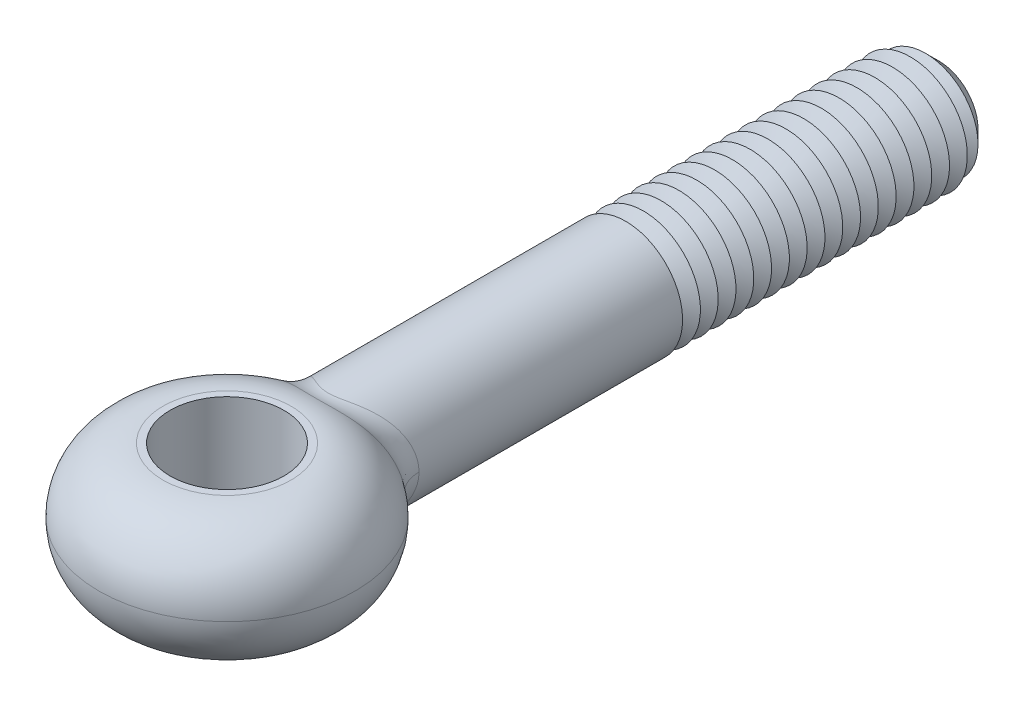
ISO-10303-21;
HEADER;
FILE_DESCRIPTION(('STEP AP214'),'2;1');
FILE_NAME('part.step','',(''),(''),'','','');
FILE_SCHEMA(('AUTOMOTIVE_DESIGN { 1 0 10303 214 1 1 1 1 }'));
ENDSEC;
DATA;
#1=APPLICATION_CONTEXT('core data for automotive mechanical design processes');
#2=APPLICATION_PROTOCOL_DEFINITION('international standard','automotive_design',2000,#1);
#3=PRODUCT_CONTEXT('',#1,'mechanical');
#4=PRODUCT('Part','Part','',(#3));
#5=PRODUCT_RELATED_PRODUCT_CATEGORY('part','',(#4));
#6=PRODUCT_DEFINITION_FORMATION('','',#4);
#7=PRODUCT_DEFINITION_CONTEXT('part definition',#1,'design');
#8=PRODUCT_DEFINITION('design','',#6,#7);
#9=PRODUCT_DEFINITION_SHAPE('','',#8);
#10=(LENGTH_UNIT() NAMED_UNIT(*) SI_UNIT(.MILLI.,.METRE.));
#11=(NAMED_UNIT(*) PLANE_ANGLE_UNIT() SI_UNIT($,.RADIAN.));
#12=(NAMED_UNIT(*) SI_UNIT($,.STERADIAN.) SOLID_ANGLE_UNIT());
#13=UNCERTAINTY_MEASURE_WITH_UNIT(LENGTH_MEASURE(1.E-05),#10,'distance_accuracy_value','');
#14=(GEOMETRIC_REPRESENTATION_CONTEXT(3) GLOBAL_UNCERTAINTY_ASSIGNED_CONTEXT((#13)) GLOBAL_UNIT_ASSIGNED_CONTEXT((#10,
#11,#12)) REPRESENTATION_CONTEXT('',''));
#15=CARTESIAN_POINT('',(0.,0.,0.));
#16=DIRECTION('',(0.,0.,1.));
#17=DIRECTION('',(1.,0.,0.));
#18=AXIS2_PLACEMENT_3D('',#15,#16,#17);
#19=CARTESIAN_POINT('',(0.,0.,-50.));
#20=DIRECTION('',(0.,0.,1.));
#21=DIRECTION('',(1.,0.,0.));
#22=AXIS2_PLACEMENT_3D('',#19,#20,#21);
#23=CYLINDRICAL_SURFACE('',#22,4.);
#24=CARTESIAN_POINT('',(0.,0.,-28.));
#25=DIRECTION('',(0.,0.,-1.));
#26=DIRECTION('',(-1.,0.,0.));
#27=AXIS2_PLACEMENT_3D('',#24,#25,#26);
#28=CIRCLE('',#27,4.);
#29=CARTESIAN_POINT('',(-4.,0.,-28.));
#30=VERTEX_POINT('',#29);
#31=EDGE_CURVE('E80',#30,#30,#28,.T.);
#32=ORIENTED_EDGE('',*,*,#31,.F.);
#33=EDGE_LOOP('',(#32));
#34=FACE_BOUND('',#33,.T.);
#35=CARTESIAN_POINT('',(4.20962840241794,-2.43928241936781,-7.13180336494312));
#36=CARTESIAN_POINT('',(3.41508318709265,-2.1022410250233,-7.85325099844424));
#37=CARTESIAN_POINT('',(3.24770536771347,-2.33503958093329,-8.94098956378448));
#38=CARTESIAN_POINT('',(4.28087481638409,-2.35167865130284,-7.15538303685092));
#39=CARTESIAN_POINT('',(3.46594050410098,-2.01878134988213,-7.88016438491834));
#40=CARTESIAN_POINT('',(3.3080123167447,-2.25117956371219,-8.98524624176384));
#41=CARTESIAN_POINT('',(4.34829202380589,-2.26129214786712,-7.17775809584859));
#42=CARTESIAN_POINT('',(3.51321978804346,-1.934229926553,-7.90531474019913));
#43=CARTESIAN_POINT('',(3.36528002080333,-2.16465573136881,-9.02717355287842));
#44=CARTESIAN_POINT('',(4.47506957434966,-2.07545821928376,-7.21991515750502));
#45=CARTESIAN_POINT('',(3.60104623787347,-1.76294616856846,-7.95222957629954));
#46=CARTESIAN_POINT('',(3.47326653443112,-1.98676342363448,-9.10606640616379));
#47=CARTESIAN_POINT('',(4.53442750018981,-1.98000928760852,-7.23969638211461));
#48=CARTESIAN_POINT('',(3.64154402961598,-1.67624067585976,-7.97396863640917));
#49=CARTESIAN_POINT('',(3.52398337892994,-1.89539350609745,-9.14303045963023));
#50=CARTESIAN_POINT('',(4.64467184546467,-1.78456033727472,-7.27647659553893));
#51=CARTESIAN_POINT('',(3.71589642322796,-1.50113175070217,-8.014023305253));
#52=CARTESIAN_POINT('',(3.61838416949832,-1.70829707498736,-9.21168368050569));
#53=CARTESIAN_POINT('',(4.69555410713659,-1.68455811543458,-7.293474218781));
#54=CARTESIAN_POINT('',(3.74970371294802,-1.41276539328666,-8.0323140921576));
#55=CARTESIAN_POINT('',(3.66206466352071,-1.6125684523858,-9.24337025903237));
#56=CARTESIAN_POINT('',(4.78841066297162,-1.4807377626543,-7.3245150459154));
#57=CARTESIAN_POINT('',(3.81076645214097,-1.23482800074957,-8.06545380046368));
#58=CARTESIAN_POINT('',(3.74191652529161,-1.41745837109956,-9.30118312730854));
#59=CARTESIAN_POINT('',(4.83038616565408,-1.37692015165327,-7.3385586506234));
#60=CARTESIAN_POINT('',(3.8379839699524,-1.1453037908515,-8.0802824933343));
#61=CARTESIAN_POINT('',(3.77808891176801,-1.31807741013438,-9.3273101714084));
#62=CARTESIAN_POINT('',(4.93998011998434,-1.06760765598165,-7.37523749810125));
#63=CARTESIAN_POINT('',(3.90855592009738,-0.880980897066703,-8.11882669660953));
#64=CARTESIAN_POINT('',(3.87264914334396,-1.02198339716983,-9.39550169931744));
#65=CARTESIAN_POINT('',(4.99497846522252,-0.857630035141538,-7.39366200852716));
#66=CARTESIAN_POINT('',(3.94292721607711,-0.705496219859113,-8.13773727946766));
#67=CARTESIAN_POINT('',(3.92027139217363,-0.8209791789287,-9.42968891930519));
#68=CARTESIAN_POINT('',(5.06845478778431,-0.431772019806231,-7.41827830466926));
#69=CARTESIAN_POINT('',(3.98870275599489,-0.353118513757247,-8.16296207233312));
#70=CARTESIAN_POINT('',(3.98393665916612,-0.413320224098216,-9.47534719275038));
#71=CARTESIAN_POINT('',(5.08696110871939,-0.215896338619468,-7.42447958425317));
#72=CARTESIAN_POINT('',(4.00000180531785,-0.176691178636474,-8.16921842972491));
#73=CARTESIAN_POINT('',(4.00000418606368,-0.206669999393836,-9.48683587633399));
#74=CARTESIAN_POINT('',(5.08695185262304,0.2197622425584,-7.42447635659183));
#75=CARTESIAN_POINT('',(3.99999816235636,0.179854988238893,-8.16921612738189));
#76=CARTESIAN_POINT('',(3.99999573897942,0.210370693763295,-9.48683003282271));
#77=CARTESIAN_POINT('',(5.06776741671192,0.439545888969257,-7.41804771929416));
#78=CARTESIAN_POINT('',(3.98828744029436,0.359474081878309,-8.16273153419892));
#79=CARTESIAN_POINT('',(3.98333904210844,0.420761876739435,-9.47492027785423));
#80=CARTESIAN_POINT('',(4.99168987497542,0.872694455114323,-7.39256061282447));
#81=CARTESIAN_POINT('',(3.94086979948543,0.718015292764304,-8.13660527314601));
#82=CARTESIAN_POINT('',(3.91742407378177,0.835399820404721,-9.42764524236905));
#83=CARTESIAN_POINT('',(4.93478135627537,1.08605671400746,-7.37349698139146));
#84=CARTESIAN_POINT('',(3.90528498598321,0.896448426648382,-8.11703072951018));
#85=CARTESIAN_POINT('',(3.86815247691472,1.03964403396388,-9.39227037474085));
#86=CARTESIAN_POINT('',(4.78531683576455,1.49992996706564,-7.32347555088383));
#87=CARTESIAN_POINT('',(3.80902553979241,1.25022198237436,-8.06447660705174));
#88=CARTESIAN_POINT('',(3.73921411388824,1.43583039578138,-9.29926343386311));
#89=CARTESIAN_POINT('',(4.69282180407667,1.70046226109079,-7.29253809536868));
#90=CARTESIAN_POINT('',(3.74864333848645,1.42515573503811,-8.03165463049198));
#91=CARTESIAN_POINT('',(3.65959933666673,1.62779293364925,-9.24166942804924));
#92=CARTESIAN_POINT('',(4.47502076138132,2.08399669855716,-7.2198795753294));
#93=CARTESIAN_POINT('',(3.60161000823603,1.76909189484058,-7.95246604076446));
#94=CARTESIAN_POINT('',(3.47312999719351,1.99493701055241,-9.10603484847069));
#95=CARTESIAN_POINT('',(4.34971613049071,2.26699957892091,-7.17815896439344));
#96=CARTESIAN_POINT('',(3.51529520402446,1.93780912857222,-7.90627607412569));
#97=CARTESIAN_POINT('',(3.36627658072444,2.17011925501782,-9.02799513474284));
#98=CARTESIAN_POINT('',(4.06503409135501,2.61710755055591,-7.08395651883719));
#99=CARTESIAN_POINT('',(3.31258804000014,2.2704191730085,-7.7990178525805));
#100=CARTESIAN_POINT('',(3.12531975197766,2.50526534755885,-8.85118504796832));
#101=CARTESIAN_POINT('',(3.90469024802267,2.78351182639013,-7.03117167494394));
#102=CARTESIAN_POINT('',(3.19569010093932,2.43389360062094,-7.73770595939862));
#103=CARTESIAN_POINT('',(2.99045029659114,2.66455832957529,-8.75182853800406));
#104=CARTESIAN_POINT('',(3.55572279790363,3.09056742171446,-6.91783262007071));
#105=CARTESIAN_POINT('',(2.93333047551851,2.74510282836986,-7.60227773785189));
#106=CARTESIAN_POINT('',(2.70000717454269,2.95849189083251,-8.5376096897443));
#107=CARTESIAN_POINT('',(3.36708914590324,3.23120955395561,-6.85727565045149));
#108=CARTESIAN_POINT('',(2.78824007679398,2.89288136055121,-7.52833413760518));
#109=CARTESIAN_POINT('',(2.54442615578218,3.09312367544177,-8.42274184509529));
#110=CARTESIAN_POINT('',(3.05590482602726,3.42698066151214,-6.7601891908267));
#111=CARTESIAN_POINT('',(2.54246419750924,3.10521527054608,-7.40650692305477));
#112=CARTESIAN_POINT('',(2.29139242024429,3.28052849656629,-8.23777021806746));
#113=CARTESIAN_POINT('',(2.94239191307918,3.49188009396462,-6.72527979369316));
#114=CARTESIAN_POINT('',(2.45203508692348,3.17679613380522,-7.3622733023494));
#115=CARTESIAN_POINT('',(2.19974288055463,3.34265444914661,-8.1711096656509));
#116=CARTESIAN_POINT('',(2.70774871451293,3.61334721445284,-6.65476356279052));
#117=CARTESIAN_POINT('',(2.2631888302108,3.31294369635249,-7.27185687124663));
#118=CARTESIAN_POINT('',(2.01195985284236,3.45893066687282,-8.03614064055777));
#119=CARTESIAN_POINT('',(2.58662025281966,3.66991688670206,-6.61915689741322));
#120=CARTESIAN_POINT('',(2.16480399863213,3.37756025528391,-7.22567879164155));
#121=CARTESIAN_POINT('',(1.91582743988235,3.51308283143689,-7.96783256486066));
#122=CARTESIAN_POINT('',(2.33643912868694,3.7746567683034,-6.5481070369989));
#123=CARTESIAN_POINT('',(1.95995542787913,3.49905860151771,-7.13254784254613));
#124=CARTESIAN_POINT('',(1.71927955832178,3.61334665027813,-7.83121951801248));
#125=CARTESIAN_POINT('',(2.20737584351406,3.82281537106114,-6.51266413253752));
#126=CARTESIAN_POINT('',(1.85349180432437,3.55598889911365,-7.08558378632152));
#127=CARTESIAN_POINT('',(1.61885840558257,3.65944719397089,-7.76291467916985));
#128=CARTESIAN_POINT('',(1.94104355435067,3.91049331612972,-6.44329335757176));
#129=CARTESIAN_POINT('',(1.6325295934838,3.66114192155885,-6.99281685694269));
#130=CARTESIAN_POINT('',(1.41399106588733,3.74337821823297,-7.62894442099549));
#131=CARTESIAN_POINT('',(1.80377767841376,3.9500159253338,-6.40936491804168));
#132=CARTESIAN_POINT('',(1.51802234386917,3.70943392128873,-6.94698677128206));
#133=CARTESIAN_POINT('',(1.3095464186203,3.78121182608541,-7.56327801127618));
#134=CARTESIAN_POINT('',(1.57227788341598,4.0073375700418,-6.35676863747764));
#135=CARTESIAN_POINT('',(1.32409359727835,3.78043323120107,-6.87537018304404));
#136=CARTESIAN_POINT('',(1.13554714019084,3.83608382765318,-7.46130151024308));
#137=CARTESIAN_POINT('',(1.48068953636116,4.02779217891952,-6.33706161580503));
#138=CARTESIAN_POINT('',(1.24725687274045,3.80602263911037,-6.84840856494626));
#139=CARTESIAN_POINT('',(1.0672193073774,3.85566430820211,-7.42304591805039));
#140=CARTESIAN_POINT('',(1.29376653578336,4.06503946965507,-6.29972707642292));
#141=CARTESIAN_POINT('',(1.09023122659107,3.85298164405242,-6.79713154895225));
#142=CARTESIAN_POINT('',(0.928835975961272,3.89131983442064,-7.35050186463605));
#143=CARTESIAN_POINT('',(1.19843101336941,4.08183129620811,-6.28210004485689));
#144=CARTESIAN_POINT('',(1.01002281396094,3.87436823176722,-6.77280179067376));
#145=CARTESIAN_POINT('',(0.858780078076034,3.90739406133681,-7.31621433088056));
#146=CARTESIAN_POINT('',(1.00443416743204,4.11153418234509,-6.24984169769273));
#147=CARTESIAN_POINT('',(0.846704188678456,3.91244466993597,-6.72814466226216));
#148=CARTESIAN_POINT('',(0.717251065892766,3.93582759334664,-7.25341859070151));
#149=CARTESIAN_POINT('',(0.905787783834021,4.12446059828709,-6.23519860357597));
#150=CARTESIAN_POINT('',(0.763580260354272,3.92916988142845,-6.70778483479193));
#151=CARTESIAN_POINT('',(0.645784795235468,3.94820159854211,-7.22488766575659));
#152=CARTESIAN_POINT('',(0.705195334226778,4.14632005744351,-6.20979408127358));
#153=CARTESIAN_POINT('',(0.594535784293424,3.95758629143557,-6.67239577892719));
#154=CARTESIAN_POINT('',(0.5013462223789,3.96912689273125,-7.17536275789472));
#155=CARTESIAN_POINT('',(0.603251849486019,4.15525614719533,-6.19902969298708));
#156=CARTESIAN_POINT('',(0.508579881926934,3.96929598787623,-6.65734565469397));
#157=CARTESIAN_POINT('',(0.428375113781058,3.97768109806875,-7.1543630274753));
#158=CARTESIAN_POINT('',(0.412029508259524,4.16793662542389,-6.18352731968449));
#159=CARTESIAN_POINT('',(0.347370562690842,3.98595413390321,-6.63565356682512));
#160=CARTESIAN_POINT('',(0.292075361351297,3.98981967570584,-7.12411158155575));
#161=CARTESIAN_POINT('',(0.32308798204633,4.17225051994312,-6.17813670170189));
#162=CARTESIAN_POINT('',(0.272375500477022,3.99164885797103,-6.62809397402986));
#163=CARTESIAN_POINT('',(0.228903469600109,3.99394921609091,-7.11358793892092));
#164=CARTESIAN_POINT('',(0.144284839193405,4.17773453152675,-6.17125850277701));
#165=CARTESIAN_POINT('',(0.121644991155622,3.99889046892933,-6.61844960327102));
#166=CARTESIAN_POINT('',(0.102130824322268,3.99919886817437,-7.10015930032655));
#167=CARTESIAN_POINT('',(0.0544233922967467,4.17890521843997,-6.16977021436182));
#168=CARTESIAN_POINT('',(0.0458757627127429,4.00044140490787,-6.61635946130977));
#169=CARTESIAN_POINT('',(0.0385301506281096,4.00031952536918,-7.09725292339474));
#170=CARTESIAN_POINT('',(-0.125189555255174,4.17807377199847,-6.17082052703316));
#171=CARTESIAN_POINT('',(-0.105535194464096,3.9993418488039,-6.61783304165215));
#172=CARTESIAN_POINT('',(-0.0886280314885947,3.99952361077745,-7.09930377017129));
#173=CARTESIAN_POINT('',(-0.214940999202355,4.17607039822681,-6.17336070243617));
#174=CARTESIAN_POINT('',(-0.181212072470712,3.99668920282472,-6.62139966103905));
#175=CARTESIAN_POINT('',(-0.152185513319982,3.9976058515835,-7.1042640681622));
#176=CARTESIAN_POINT('',(-0.393267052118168,4.16893881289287,-6.18226051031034));
#177=CARTESIAN_POINT('',(-0.331541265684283,3.98728173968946,-6.633873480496));
#178=CARTESIAN_POINT('',(-0.278751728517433,3.99077903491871,-7.12163796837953));
#179=CARTESIAN_POINT('',(-0.481841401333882,4.16380992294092,-6.18862097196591));
#180=CARTESIAN_POINT('',(-0.406226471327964,3.98052180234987,-6.64278739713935));
#181=CARTESIAN_POINT('',(-0.341760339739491,3.98586932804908,-7.13405318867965));
#182=CARTESIAN_POINT('',(-0.688095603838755,4.14817563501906,-6.20755254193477));
#183=CARTESIAN_POINT('',(-0.580119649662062,3.96002144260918,-6.66925886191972));
#184=CARTESIAN_POINT('',(-0.48906356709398,3.97090317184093,-7.17098958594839));
#185=CARTESIAN_POINT('',(-0.804946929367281,4.13640802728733,-6.22152677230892));
#186=CARTESIAN_POINT('',(-0.678644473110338,3.9446436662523,-6.68877522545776));
#187=CARTESIAN_POINT('',(-0.57297516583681,3.95963845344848,-7.19824359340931));
#188=CARTESIAN_POINT('',(-1.03394062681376,4.1076481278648,-6.25415363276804));
#189=CARTESIAN_POINT('',(-0.871568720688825,3.90744263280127,-6.73412611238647));
#190=CARTESIAN_POINT('',(-0.73864371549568,3.93210760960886,-7.26181631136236));
#191=CARTESIAN_POINT('',(-1.14608021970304,4.09065280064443,-6.27280897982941));
#192=CARTESIAN_POINT('',(-0.966017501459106,3.88559131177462,-6.75999090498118));
#193=CARTESIAN_POINT('',(-0.820399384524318,3.9158385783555,-7.29814028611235));
#194=CARTESIAN_POINT('',(-1.36592763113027,4.05161532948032,-6.31347216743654));
#195=CARTESIAN_POINT('',(-1.15091612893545,3.83597962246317,-6.81605607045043));
#196=CARTESIAN_POINT('',(-0.982033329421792,3.87846937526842,-7.37722308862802));
#197=CARTESIAN_POINT('',(-1.47361079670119,4.02954864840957,-6.33549612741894));
#198=CARTESIAN_POINT('',(-1.24137763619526,3.80816351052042,-6.84630178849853));
#199=CARTESIAN_POINT('',(-1.06190032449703,3.85734571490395,-7.42001284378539));
#200=CARTESIAN_POINT('',(-1.68409994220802,3.98060721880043,-6.38167314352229));
#201=CARTESIAN_POINT('',(-1.41779320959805,3.74723624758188,-6.90932190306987));
#202=CARTESIAN_POINT('',(-1.21937267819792,3.81049579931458,-7.50960647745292));
#203=CARTESIAN_POINT('',(-1.7869061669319,3.95373271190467,-6.40582609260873));
#204=CARTESIAN_POINT('',(-1.50376847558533,3.71409743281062,-6.94211616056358));
#205=CARTESIAN_POINT('',(-1.29697815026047,3.78476977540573,-7.55641015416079));
#206=CARTESIAN_POINT('',(-2.03557249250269,3.88144037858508,-6.46712101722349));
#207=CARTESIAN_POINT('',(-1.71119137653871,3.62603584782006,-7.02483194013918));
#208=CARTESIAN_POINT('',(-1.48626510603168,3.71556685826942,-7.67500708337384));
#209=CARTESIAN_POINT('',(-2.17875790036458,3.8332690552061,-6.50499609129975));
#210=CARTESIAN_POINT('',(-1.82993325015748,3.568260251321,-7.07544885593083));
#211=CARTESIAN_POINT('',(-1.59667404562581,3.66945413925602,-7.74813538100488));
#212=CARTESIAN_POINT('',(-2.45590601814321,3.72693983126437,-6.58149722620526));
#213=CARTESIAN_POINT('',(-2.05811594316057,3.44332588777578,-7.17652007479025));
#214=CARTESIAN_POINT('',(-1.81273207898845,3.56766889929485,-7.8954804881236));
#215=CARTESIAN_POINT('',(-2.58986577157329,3.66877875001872,-6.62012352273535));
#216=CARTESIAN_POINT('',(-2.16754889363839,3.37608608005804,-7.22699422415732));
#217=CARTESIAN_POINT('',(-1.9183796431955,3.51199333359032,-7.96969763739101));
#218=CARTESIAN_POINT('',(-2.84860171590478,3.5427552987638,-6.69676099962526));
#219=CARTESIAN_POINT('',(-2.37693766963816,3.23337235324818,-7.32592299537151));
#220=CARTESIAN_POINT('',(-2.12436385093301,3.39135549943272,-8.11658331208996));
#221=CARTESIAN_POINT('',(-2.97339489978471,3.47491160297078,-6.73477321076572));
#222=CARTESIAN_POINT('',(-2.4768805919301,3.15784823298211,-7.37438139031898));
#223=CARTESIAN_POINT('',(-2.22471021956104,3.32641110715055,-8.18925451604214));
#224=CARTESIAN_POINT('',(-3.21406230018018,3.32961759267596,-6.80935300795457));
#225=CARTESIAN_POINT('',(-2.6674564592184,2.99941031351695,-7.4682507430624));
#226=CARTESIAN_POINT('',(-2.41977314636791,3.18732624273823,-8.33148796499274));
#227=CARTESIAN_POINT('',(-3.32993337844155,3.2521639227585,-6.84592008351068));
#228=CARTESIAN_POINT('',(-2.75803338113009,2.91644504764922,-7.51364407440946));
#229=CARTESIAN_POINT('',(-2.5144877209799,3.11318255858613,-8.40104911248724));
#230=CARTESIAN_POINT('',(-3.55210969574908,3.08816037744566,-6.91681788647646));
#231=CARTESIAN_POINT('',(-2.92947959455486,2.74434343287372,-7.60050775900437));
#232=CARTESIAN_POINT('',(-2.69730128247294,2.95618771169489,-8.53560605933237));
#233=CARTESIAN_POINT('',(-3.65843710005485,3.00163264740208,-6.95115374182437));
#234=CARTESIAN_POINT('',(-3.01030527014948,2.65519145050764,-7.64195973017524));
#235=CARTESIAN_POINT('',(-2.78541551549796,2.87335774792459,-8.6006123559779));
#236=CARTESIAN_POINT('',(-3.86134707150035,2.81971508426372,-7.01714488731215));
#237=CARTESIAN_POINT('',(-3.16239702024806,2.47150088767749,-7.72058753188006));
#238=CARTESIAN_POINT('',(-2.95448336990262,2.69921443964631,-8.725285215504));
#239=CARTESIAN_POINT('',(-3.95792606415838,2.72432202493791,-7.04879919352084));
#240=CARTESIAN_POINT('',(-3.23358189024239,2.37695238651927,-7.75772562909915));
#241=CARTESIAN_POINT('',(-3.03543436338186,2.6078980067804,-8.78494981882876));
#242=CARTESIAN_POINT('',(-4.14062182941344,2.52529349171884,-7.10894613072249));
#243=CARTESIAN_POINT('',(-3.36627848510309,2.18351039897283,-7.82739060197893));
#244=CARTESIAN_POINT('',(-3.18924486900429,2.41737496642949,-8.89810456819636));
#245=CARTESIAN_POINT('',(-4.22674123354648,2.42166010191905,-7.13743955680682));
#246=CARTESIAN_POINT('',(-3.42771044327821,2.08463231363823,-7.85987815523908));
#247=CARTESIAN_POINT('',(-3.26210641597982,2.31817035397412,-8.95159626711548));
#248=CARTESIAN_POINT('',(-4.38787338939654,2.20680171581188,-7.19089612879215));
#249=CARTESIAN_POINT('',(-3.54098239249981,1.88340090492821,-7.92009157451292));
#250=CARTESIAN_POINT('',(-3.39891556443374,2.11249395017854,-9.05178694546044));
#251=CARTESIAN_POINT('',(-4.46288140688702,2.09557351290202,-7.21585776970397));
#252=CARTESIAN_POINT('',(-3.59273623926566,1.78108328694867,-7.94777357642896));
#253=CARTESIAN_POINT('',(-3.46285936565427,2.00601908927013,-9.0984830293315));
#254=CARTESIAN_POINT('',(-4.59457320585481,1.87716338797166,-7.25975188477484));
#255=CARTESIAN_POINT('',(-3.68233447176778,1.58359654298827,-7.99590902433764));
#256=CARTESIAN_POINT('',(-3.57543701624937,1.7969427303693,-9.18048322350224));
#257=CARTESIAN_POINT('',(-4.65231387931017,1.77057286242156,-7.27902964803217));
#258=CARTESIAN_POINT('',(-3.72098386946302,1.4886580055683,-8.01677413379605));
#259=CARTESIAN_POINT('',(-3.62494279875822,1.69490735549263,-9.21644383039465));
#260=CARTESIAN_POINT('',(-4.75753290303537,1.55269637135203,-7.31418809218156));
#261=CARTESIAN_POINT('',(-3.79061799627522,1.29722505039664,-8.05449646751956));
#262=CARTESIAN_POINT('',(-3.71533333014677,1.48634182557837,-9.28196073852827));
#263=CARTESIAN_POINT('',(-4.80501232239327,1.4414108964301,-7.33006912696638));
#264=CARTESIAN_POINT('',(-3.82155281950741,1.20078670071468,-8.07132717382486));
#265=CARTESIAN_POINT('',(-3.75621897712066,1.37981214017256,-9.31151770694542));
#266=CARTESIAN_POINT('',(-4.88918515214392,1.21522310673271,-7.35823582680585));
#267=CARTESIAN_POINT('',(-3.87588351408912,1.00699635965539,-8.10097036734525));
#268=CARTESIAN_POINT('',(-3.82880765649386,1.16329049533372,-9.36389868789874));
#269=CARTESIAN_POINT('',(-4.92589907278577,1.10032813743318,-7.3705283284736));
#270=CARTESIAN_POINT('',(-3.89925185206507,0.909712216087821,-8.11376793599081));
#271=CARTESIAN_POINT('',(-3.86052814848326,1.05330556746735,-9.38673550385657));
#272=CARTESIAN_POINT('',(-4.98828435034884,0.867715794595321,-7.39142041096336));
#273=CARTESIAN_POINT('',(-3.93869332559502,0.714454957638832,-8.13541291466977));
#274=CARTESIAN_POINT('',(-3.91448130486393,0.830633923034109,-9.42552718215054));
#275=CARTESIAN_POINT('',(-5.01396103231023,0.749999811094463,-7.4000217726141));
#276=CARTESIAN_POINT('',(-3.95473808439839,0.616556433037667,-8.14424484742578));
#277=CARTESIAN_POINT('',(-3.93671854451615,0.717948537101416,-9.4414853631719));
#278=CARTESIAN_POINT('',(-5.05160356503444,0.527069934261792,-7.41263256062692));
#279=CARTESIAN_POINT('',(-3.97817394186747,0.432202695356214,-8.15716098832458));
#280=CARTESIAN_POINT('',(-3.96933623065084,0.504545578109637,-9.46487511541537));
#281=CARTESIAN_POINT('',(-5.06485252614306,0.422066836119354,-7.41707168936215));
#282=CARTESIAN_POINT('',(-3.98636384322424,0.345839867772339,-8.16168301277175));
#283=CARTESIAN_POINT('',(-3.98082580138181,0.404029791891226,-9.47310478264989));
#284=CARTESIAN_POINT('',(-5.08253053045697,0.211392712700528,-7.42299491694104));
#285=CARTESIAN_POINT('',(-3.99727804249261,0.172971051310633,-8.16771217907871));
#286=CARTESIAN_POINT('',(-3.99615939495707,0.202358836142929,-9.48408450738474));
#287=CARTESIAN_POINT('',(-5.0869624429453,0.105721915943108,-7.42447997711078));
#288=CARTESIAN_POINT('',(-3.99999698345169,0.0865213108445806,-8.16921636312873));
#289=CARTESIAN_POINT('',(-4.00000590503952,0.101203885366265,-9.48683634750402));
#290=CARTESIAN_POINT('',(-5.08694423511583,-0.219375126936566,-7.42447385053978));
#291=CARTESIAN_POINT('',(-4.00000625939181,-0.179533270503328,-8.16921920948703));
#292=CARTESIAN_POINT('',(-3.99998774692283,-0.210000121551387,-9.48682599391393));
#293=CARTESIAN_POINT('',(-5.06782392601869,-0.438970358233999,-7.41806690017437));
#294=CARTESIAN_POINT('',(-3.98832493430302,-0.358996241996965,-8.16275208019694));
#295=CARTESIAN_POINT('',(-3.98338811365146,-0.420210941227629,-9.47495588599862));
#296=CARTESIAN_POINT('',(-4.99181098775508,-0.872258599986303,-7.39260093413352));
#297=CARTESIAN_POINT('',(-3.94094286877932,-0.717656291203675,-8.13664564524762));
#298=CARTESIAN_POINT('',(-3.91752889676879,-0.83498259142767,-9.42771999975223));
#299=CARTESIAN_POINT('',(-4.93481503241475,-1.08593379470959,-7.37350730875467));
#300=CARTESIAN_POINT('',(-3.9053086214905,-0.89636142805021,-8.11704297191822));
#301=CARTESIAN_POINT('',(-3.86817997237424,-1.03952636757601,-9.3922899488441));
#302=CARTESIAN_POINT('',(-4.82260503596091,-1.39669226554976,-7.33595529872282));
#303=CARTESIAN_POINT('',(-3.8329428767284,-1.16232084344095,-8.07753492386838));
#304=CARTESIAN_POINT('',(-3.77138225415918,-1.3370045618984,-9.32246736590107));
#305=CARTESIAN_POINT('',(-4.78077456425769,-1.4986077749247,-7.32196123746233));
#306=CARTESIAN_POINT('',(-3.80577950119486,-1.25032878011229,-8.0627417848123));
#307=CARTESIAN_POINT('',(-3.73534257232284,-1.43456470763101,-9.29642949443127));
#308=CARTESIAN_POINT('',(-4.6885140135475,-1.6987113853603,-7.29112215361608));
#309=CARTESIAN_POINT('',(-3.74503190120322,-1.42524573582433,-8.02978510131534));
#310=CARTESIAN_POINT('',(-3.65601915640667,-1.62611688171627,-9.23898630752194));
#311=CARTESIAN_POINT('',(-4.63808284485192,-1.79689901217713,-7.27427676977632));
#312=CARTESIAN_POINT('',(-3.7114841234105,-1.51211059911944,-8.01164097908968));
#313=CARTESIAN_POINT('',(-3.6127345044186,-1.72010845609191,-9.20758031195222));
#314=CARTESIAN_POINT('',(-4.52912947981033,-1.98866953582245,-7.23793066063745));
#315=CARTESIAN_POINT('',(-3.63793253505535,-1.68409419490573,-7.97202907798));
#316=CARTESIAN_POINT('',(-3.51945525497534,-1.90368365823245,-9.13973150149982));
#317=CARTESIAN_POINT('',(-4.47062629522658,-2.08226257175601,-7.21843617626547));
#318=CARTESIAN_POINT('',(-3.59798595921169,-1.76918038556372,-7.95059120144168));
#319=CARTESIAN_POINT('',(-3.46947643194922,-1.99327699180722,-9.10330052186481));
#320=CARTESIAN_POINT('',(-4.34585406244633,-2.2645576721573,-7.17694883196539));
#321=CARTESIAN_POINT('',(-3.51150587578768,-1.93729298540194,-7.90440294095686));
#322=CARTESIAN_POINT('',(-3.36320902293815,-2.16778170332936,-9.02565711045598));
#323=CARTESIAN_POINT('',(-4.27958724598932,-2.3532611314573,-7.15495669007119));
#324=CARTESIAN_POINT('',(-3.46501911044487,-2.02029414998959,-7.87967661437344));
#325=CARTESIAN_POINT('',(-3.30692225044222,-2.2526944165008,-8.98444605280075));
#326=CARTESIAN_POINT('',(-4.20962840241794,-2.43928241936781,-7.13180336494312));
#327=CARTESIAN_POINT('',(-3.41508318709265,-2.1022410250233,-7.85325099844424));
#328=CARTESIAN_POINT('',(-3.24770536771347,-2.33503958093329,-8.94098956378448));
#329=(BOUNDED_SURFACE() B_SPLINE_SURFACE(3,2,((#35,#36,#37),(#38,#39,#40),(#41,#42,#43),(#44,
#45,#46),(#47,#48,#49),(#50,#51,#52),(#53,#54,#55),(#56,#57,#58),(#59,#60,#61),(#62,#63,#64),
(#65,#66,#67),(#68,#69,#70),(#71,#72,#73),(#74,#75,#76),(#77,#78,#79),(#80,#81,#82),(#83,#84,
#85),(#86,#87,#88),(#89,#90,#91),(#92,#93,#94),(#95,#96,#97),(#98,#99,#100),(#101,#102,#103),
(#104,#105,#106),(#107,#108,#109),(#110,#111,#112),(#113,#114,#115),(#116,#117,#118),(#119,#120,
#121),(#122,#123,#124),(#125,#126,#127),(#128,#129,#130),(#131,#132,#133),(#134,#135,#136),
(#137,#138,#139),(#140,#141,#142),(#143,#144,#145),(#146,#147,#148),(#149,#150,#151),(#152,#153,
#154),(#155,#156,#157),(#158,#159,#160),(#161,#162,#163),(#164,#165,#166),(#167,#168,#169),
(#170,#171,#172),(#173,#174,#175),(#176,#177,#178),(#179,#180,#181),(#182,#183,#184),(#185,#186,
#187),(#188,#189,#190),(#191,#192,#193),(#194,#195,#196),(#197,#198,#199),(#200,#201,#202),
(#203,#204,#205),(#206,#207,#208),(#209,#210,#211),(#212,#213,#214),(#215,#216,#217),(#218,#219,
#220),(#221,#222,#223),(#224,#225,#226),(#227,#228,#229),(#230,#231,#232),(#233,#234,#235),
(#236,#237,#238),(#239,#240,#241),(#242,#243,#244),(#245,#246,#247),(#248,#249,#250),(#251,#252,
#253),(#254,#255,#256),(#257,#258,#259),(#260,#261,#262),(#263,#264,#265),(#266,#267,#268),
(#269,#270,#271),(#272,#273,#274),(#275,#276,#277),(#278,#279,#280),(#281,#282,#283),(#284,#285,
#286),(#287,#288,#289),(#290,#291,#292),(#293,#294,#295),(#296,#297,#298),(#299,#300,#301),
(#302,#303,#304),(#305,#306,#307),(#308,#309,#310),(#311,#312,#313),(#314,#315,#316),(#317,#318,
#319),(#320,#321,#322),(#323,#324,#325),(#326,#327,#328)),.UNSPECIFIED.,.F.,.F.,
.F.) B_SPLINE_SURFACE_WITH_KNOTS((4,2,2,2,2,2,2,2,2,2,2,2,2,2,2,2,2,2,2,2,2,2,2,2,2,2,2,2,2,2,2,
2,2,2,2,2,2,2,2,2,2,2,2,2,2,2,2,2,4),(3,3),(0.,0.520645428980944,1.04144667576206,
1.56250265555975,2.08348789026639,3.09060934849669,4.09694825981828,5.12130697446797,
6.14608446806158,7.16911398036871,8.19210046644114,9.2479961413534,10.3042676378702,
10.8793995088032,11.4543941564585,12.0301760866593,12.6057398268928,12.9705703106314,
13.3354858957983,13.6989318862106,14.0620999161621,14.3719634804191,14.6817708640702,
14.9916993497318,15.301695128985,15.7217247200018,16.1419986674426,16.5643505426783,
16.9866811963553,17.6090733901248,18.2316641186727,18.8530699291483,19.4746933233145,
20.0948334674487,20.7152001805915,21.335410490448,21.9558842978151,22.5184424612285,
23.0809419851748,23.6423627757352,24.2035123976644,24.6967605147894,25.1898480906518,
26.2130148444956,27.2389843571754,27.7514948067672,28.2640702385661,28.7754583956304,
29.2866999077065),(0.,1.),
.UNSPECIFIED.) GEOMETRIC_REPRESENTATION_ITEM() RATIONAL_B_SPLINE_SURFACE(((1.,0.911936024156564,
1.),(1.,0.909850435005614,1.),(1.,0.907844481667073,1.),(1.,0.904024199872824,1.),(1.,
0.902209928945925,1.),(1.,0.898805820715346,1.),(1.,0.897216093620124,1.),(1.,0.894291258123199,
1.),(1.,0.892956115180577,1.),(1.,0.889449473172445,1.),(1.,0.887660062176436,1.),(1.,
0.885261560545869,1.),(1.,0.884651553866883,1.),(1.,0.884651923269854,1.),(1.,0.885284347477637,
1.),(1.,0.887767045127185,1.),(1.,0.889617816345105,1.),(1.,0.894396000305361,1.),(1.,
0.897321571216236,1.),(1.,0.904041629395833,1.),(1.,0.907836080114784,1.),(1.,0.91616786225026,
1.),(1.,0.920725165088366,1.),(1.,0.930174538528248,1.),(1.,0.935066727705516,1.),(1.,
0.942600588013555,1.),(1.,0.945252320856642,1.),(1.,0.950486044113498,1.),(1.,0.953068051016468,
1.),(1.,0.958095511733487,1.),(1.,0.960540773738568,1.),(1.,0.965207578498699,1.),(1.,
0.967429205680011,1.),(1.,0.970790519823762,1.),(1.,0.972028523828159,1.),(1.,0.974339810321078,
1.),(1.,0.975413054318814,1.),(1.,0.97735209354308,1.),(1.,0.978218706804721,1.),(1.,
0.979707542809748,1.),(1.,0.980329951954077,1.),(1.,0.981221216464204,1.),(1.,0.981528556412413,
1.),(1.,0.981920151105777,1.),(1.,0.982004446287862,1.),(1.,0.981944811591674,1.),(1.,
0.981800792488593,1.),(1.,0.981293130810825,1.),(1.,0.98092944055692,1.),(1.,0.979837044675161,
1.),(1.,0.979024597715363,1.),(1.,0.977095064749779,1.),(1.,0.975977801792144,1.),(1.,
0.973495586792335,1.),(1.,0.972129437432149,1.),(1.,0.969207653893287,1.),(1.,0.967652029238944,
1.),(1.,0.963624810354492,1.),(1.,0.961068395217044,1.),(1.,0.955756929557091,1.),(1.,
0.95300181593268,1.),(1.,0.947392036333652,1.),(1.,0.94453756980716,1.),(1.,0.938804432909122,
1.),(1.,0.935925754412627,1.),(1.,0.930226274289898,1.),(1.,0.927405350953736,1.),(1.,
0.921882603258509,1.),(1.,0.919180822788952,1.),(1.,0.913963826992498,1.),(1.,0.9114485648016,
1.),(1.,0.906664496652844,1.),(1.,0.904395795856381,1.),(1.,0.900360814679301,1.),(1.,
0.898567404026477,1.),(1.,0.89526897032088,1.),(1.,0.893763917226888,1.),(1.,0.89107726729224,
1.),(1.,0.889895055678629,1.),(1.,0.88787678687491,1.),(1.,0.887040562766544,1.),(1.,
0.885811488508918,1.),(1.,0.88537723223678,1.),(1.,0.884797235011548,1.),(1.,0.884651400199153,
1.),(1.,0.884652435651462,1.),(1.,0.885282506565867,1.),(1.,0.887763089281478,1.),(1.,
0.889616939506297,1.),(1.,0.893203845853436,1.),(1.,0.894533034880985,1.),(1.,0.897436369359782,
1.),(1.,0.899010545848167,1.),(1.,0.902372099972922,1.),(1.,0.904158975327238,1.),(1.,
0.907917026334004,1.),(1.,0.909888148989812,1.),(1.,0.911936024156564,1.))) REPRESENTATION_ITEM('') SURFACE());
#330=CARTESIAN_POINT('',(-3.24770536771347,-2.33503958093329,-8.94098956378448));
#331=CARTESIAN_POINT('',(-3.30692225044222,-2.2526944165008,-8.98444605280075));
#332=CARTESIAN_POINT('',(-3.36320902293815,-2.16778170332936,-9.02565711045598));
#333=CARTESIAN_POINT('',(-3.46947643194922,-1.99327699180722,-9.10330052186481));
#334=CARTESIAN_POINT('',(-3.51945525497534,-1.90368365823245,-9.13973150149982));
#335=CARTESIAN_POINT('',(-3.6127345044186,-1.72010845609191,-9.20758031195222));
#336=CARTESIAN_POINT('',(-3.65601915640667,-1.62611688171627,-9.23898630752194));
#337=CARTESIAN_POINT('',(-3.73534257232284,-1.43456470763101,-9.29642949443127));
#338=CARTESIAN_POINT('',(-3.77138225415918,-1.3370045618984,-9.32246736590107));
#339=CARTESIAN_POINT('',(-3.86817997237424,-1.03952636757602,-9.3922899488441));
#340=CARTESIAN_POINT('',(-3.91752889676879,-0.83498259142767,-9.42771999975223));
#341=CARTESIAN_POINT('',(-3.98338811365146,-0.420210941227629,-9.47495588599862));
#342=CARTESIAN_POINT('',(-3.99998774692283,-0.210000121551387,-9.48682599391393));
#343=CARTESIAN_POINT('',(-4.00000590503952,0.101203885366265,-9.48683634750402));
#344=CARTESIAN_POINT('',(-3.99615939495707,0.202358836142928,-9.48408450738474));
#345=CARTESIAN_POINT('',(-3.98082580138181,0.404029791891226,-9.47310478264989));
#346=CARTESIAN_POINT('',(-3.96933623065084,0.504545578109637,-9.46487511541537));
#347=CARTESIAN_POINT('',(-3.93671854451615,0.717948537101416,-9.4414853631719));
#348=CARTESIAN_POINT('',(-3.91448130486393,0.830633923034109,-9.42552718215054));
#349=CARTESIAN_POINT('',(-3.86052814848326,1.05330556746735,-9.38673550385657));
#350=CARTESIAN_POINT('',(-3.82880765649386,1.16329049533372,-9.36389868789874));
#351=CARTESIAN_POINT('',(-3.75621897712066,1.37981214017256,-9.31151770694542));
#352=CARTESIAN_POINT('',(-3.71533333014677,1.48634182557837,-9.28196073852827));
#353=CARTESIAN_POINT('',(-3.62494279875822,1.69490735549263,-9.21644383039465));
#354=CARTESIAN_POINT('',(-3.57543701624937,1.7969427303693,-9.18048322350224));
#355=CARTESIAN_POINT('',(-3.46285936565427,2.00601908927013,-9.0984830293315));
#356=CARTESIAN_POINT('',(-3.39891556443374,2.11249395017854,-9.05178694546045));
#357=CARTESIAN_POINT('',(-3.26210641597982,2.31817035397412,-8.95159626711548));
#358=CARTESIAN_POINT('',(-3.18924486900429,2.41737496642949,-8.89810456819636));
#359=CARTESIAN_POINT('',(-3.03543436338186,2.6078980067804,-8.78494981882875));
#360=CARTESIAN_POINT('',(-2.95448336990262,2.69921443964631,-8.725285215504));
#361=CARTESIAN_POINT('',(-2.78541551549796,2.87335774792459,-8.6006123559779));
#362=CARTESIAN_POINT('',(-2.69730128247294,2.95618771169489,-8.53560605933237));
#363=CARTESIAN_POINT('',(-2.5144877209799,3.11318255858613,-8.40104911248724));
#364=CARTESIAN_POINT('',(-2.41977314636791,3.18732624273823,-8.33148796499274));
#365=CARTESIAN_POINT('',(-2.22471021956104,3.32641110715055,-8.18925451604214));
#366=CARTESIAN_POINT('',(-2.12436385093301,3.39135549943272,-8.11658331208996));
#367=CARTESIAN_POINT('',(-1.9183796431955,3.51199333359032,-7.96969763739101));
#368=CARTESIAN_POINT('',(-1.81273207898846,3.56766889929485,-7.8954804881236));
#369=CARTESIAN_POINT('',(-1.59667404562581,3.66945413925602,-7.74813538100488));
#370=CARTESIAN_POINT('',(-1.48626510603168,3.71556685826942,-7.67500708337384));
#371=CARTESIAN_POINT('',(-1.29697815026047,3.78476977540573,-7.55641015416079));
#372=CARTESIAN_POINT('',(-1.21937267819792,3.81049579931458,-7.50960647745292));
#373=CARTESIAN_POINT('',(-1.06190032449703,3.85734571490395,-7.42001284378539));
#374=CARTESIAN_POINT('',(-0.982033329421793,3.87846937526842,-7.37722308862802));
#375=CARTESIAN_POINT('',(-0.820399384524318,3.9158385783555,-7.29814028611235));
#376=CARTESIAN_POINT('',(-0.73864371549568,3.93210760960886,-7.26181631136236));
#377=CARTESIAN_POINT('',(-0.572975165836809,3.95963845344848,-7.19824359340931));
#378=CARTESIAN_POINT('',(-0.48906356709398,3.97090317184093,-7.17098958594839));
#379=CARTESIAN_POINT('',(-0.341760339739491,3.98586932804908,-7.13405318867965));
#380=CARTESIAN_POINT('',(-0.278751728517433,3.99077903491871,-7.12163796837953));
#381=CARTESIAN_POINT('',(-0.152185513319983,3.9976058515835,-7.1042640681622));
#382=CARTESIAN_POINT('',(-0.0886280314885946,3.99952361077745,-7.09930377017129));
#383=CARTESIAN_POINT('',(0.0385301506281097,4.00031952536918,-7.09725292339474));
#384=CARTESIAN_POINT('',(0.102130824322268,3.99919886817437,-7.10015930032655));
#385=CARTESIAN_POINT('',(0.228903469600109,3.99394921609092,-7.11358793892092));
#386=CARTESIAN_POINT('',(0.292075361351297,3.98981967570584,-7.12411158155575));
#387=CARTESIAN_POINT('',(0.428375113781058,3.97768109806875,-7.1543630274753));
#388=CARTESIAN_POINT('',(0.5013462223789,3.96912689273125,-7.17536275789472));
#389=CARTESIAN_POINT('',(0.645784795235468,3.94820159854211,-7.22488766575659));
#390=CARTESIAN_POINT('',(0.717251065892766,3.93582759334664,-7.25341859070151));
#391=CARTESIAN_POINT('',(0.858780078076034,3.90739406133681,-7.31621433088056));
#392=CARTESIAN_POINT('',(0.928835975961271,3.89131983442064,-7.35050186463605));
#393=CARTESIAN_POINT('',(1.0672193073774,3.85566430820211,-7.42304591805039));
#394=CARTESIAN_POINT('',(1.13554714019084,3.83608382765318,-7.46130151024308));
#395=CARTESIAN_POINT('',(1.3095464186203,3.78121182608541,-7.56327801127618));
#396=CARTESIAN_POINT('',(1.41399106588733,3.74337821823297,-7.62894442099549));
#397=CARTESIAN_POINT('',(1.61885840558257,3.65944719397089,-7.76291467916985));
#398=CARTESIAN_POINT('',(1.71927955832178,3.61334665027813,-7.83121951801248));
#399=CARTESIAN_POINT('',(1.91582743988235,3.51308283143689,-7.96783256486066));
#400=CARTESIAN_POINT('',(2.01195985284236,3.45893066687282,-8.03614064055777));
#401=CARTESIAN_POINT('',(2.19974288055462,3.34265444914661,-8.1711096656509));
#402=CARTESIAN_POINT('',(2.29139242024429,3.28052849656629,-8.23777021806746));
#403=CARTESIAN_POINT('',(2.54442615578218,3.09312367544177,-8.42274184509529));
#404=CARTESIAN_POINT('',(2.70000717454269,2.95849189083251,-8.5376096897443));
#405=CARTESIAN_POINT('',(2.99045029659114,2.66455832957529,-8.75182853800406));
#406=CARTESIAN_POINT('',(3.12531975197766,2.50526534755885,-8.85118504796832));
#407=CARTESIAN_POINT('',(3.36627658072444,2.17011925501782,-9.02799513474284));
#408=CARTESIAN_POINT('',(3.47312999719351,1.99493701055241,-9.10603484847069));
#409=CARTESIAN_POINT('',(3.65959933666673,1.62779293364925,-9.24166942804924));
#410=CARTESIAN_POINT('',(3.73921411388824,1.43583039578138,-9.29926343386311));
#411=CARTESIAN_POINT('',(3.86815247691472,1.03964403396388,-9.39227037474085));
#412=CARTESIAN_POINT('',(3.91742407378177,0.835399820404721,-9.42764524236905));
#413=CARTESIAN_POINT('',(3.98333904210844,0.420761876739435,-9.47492027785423));
#414=CARTESIAN_POINT('',(3.99999573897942,0.210370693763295,-9.4868300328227));
#415=CARTESIAN_POINT('',(4.00000418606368,-0.206669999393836,-9.48683587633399));
#416=CARTESIAN_POINT('',(3.98393665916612,-0.413320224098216,-9.47534719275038));
#417=CARTESIAN_POINT('',(3.92027139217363,-0.8209791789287,-9.42968891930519));
#418=CARTESIAN_POINT('',(3.87264914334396,-1.02198339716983,-9.39550169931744));
#419=CARTESIAN_POINT('',(3.77808891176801,-1.31807741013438,-9.3273101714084));
#420=CARTESIAN_POINT('',(3.74191652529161,-1.41745837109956,-9.30118312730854));
#421=CARTESIAN_POINT('',(3.66206466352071,-1.6125684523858,-9.24337025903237));
#422=CARTESIAN_POINT('',(3.61838416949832,-1.70829707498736,-9.21168368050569));
#423=CARTESIAN_POINT('',(3.52398337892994,-1.89539350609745,-9.14303045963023));
#424=CARTESIAN_POINT('',(3.47326653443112,-1.98676342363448,-9.10606640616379));
#425=CARTESIAN_POINT('',(3.36528002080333,-2.16465573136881,-9.02717355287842));
#426=CARTESIAN_POINT('',(3.3080123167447,-2.25117956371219,-8.98524624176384));
#427=CARTESIAN_POINT('',(3.24770536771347,-2.33503958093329,-8.94098956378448));
#428=B_SPLINE_CURVE_WITH_KNOTS('',3,(#330,#331,#332,#333,#334,#335,#336,#337,#338,#339,#340,
#341,#342,#343,#344,#345,#346,#347,#348,#349,#350,#351,#352,#353,#354,#355,#356,#357,#358,#359,
#360,#361,#362,#363,#364,#365,#366,#367,#368,#369,#370,#371,#372,#373,#374,#375,#376,#377,#378,
#379,#380,#381,#382,#383,#384,#385,#386,#387,#388,#389,#390,#391,#392,#393,#394,#395,#396,#397,
#398,#399,#400,#401,#402,#403,#404,#405,#406,#407,#408,#409,#410,#411,#412,#413,#414,#415,#416,
#417,#418,#419,#420,#421,#422,#423,#424,#425,#426,#427),.UNSPECIFIED.,.F.,.F.,(4,2,2,2,2,2,2,2,
2,2,2,2,2,2,2,2,2,2,2,2,2,2,2,2,2,2,2,2,2,2,2,2,2,2,2,2,2,2,2,2,2,2,2,2,2,2,2,2,4),(0.,
0.511241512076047,1.02262966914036,1.53520510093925,2.04771555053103,3.07368506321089,
4.09685181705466,4.58993939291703,5.08318751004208,5.64433713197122,6.2057579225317,
6.768257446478,7.33081560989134,7.95128941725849,8.57149972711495,9.19186644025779,
9.81200658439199,10.4336299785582,11.0550357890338,11.6776265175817,12.3000187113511,
12.7223493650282,13.1447012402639,13.5649751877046,13.9850047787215,14.2950005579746,
14.6049290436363,14.9147364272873,15.2245999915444,15.5877680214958,15.9512140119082,
16.3161295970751,16.6809600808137,17.2565238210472,17.8323057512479,18.4073003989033,
18.9824322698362,20.0387037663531,21.0945994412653,22.1175859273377,23.1406154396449,
24.1653929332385,25.1897516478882,26.1960905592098,27.2032120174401,27.7241972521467,
28.2452532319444,28.7660544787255,29.2866999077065),.UNSPECIFIED.);
#429=CARTESIAN_POINT('',(-4.,0.,-9.48683298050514));
#430=VERTEX_POINT('',#429);
#431=CARTESIAN_POINT('',(4.,0.,-9.48683298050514));
#432=VERTEX_POINT('',#431);
#433=EDGE_CURVE('E82',#430,#432,#428,.T.);
#434=ORIENTED_EDGE('',*,*,#433,.T.);
#435=CARTESIAN_POINT('',(-4.20962840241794,2.43928241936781,-7.13180336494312));
#436=CARTESIAN_POINT('',(-3.41508318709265,2.1022410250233,-7.85325099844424));
#437=CARTESIAN_POINT('',(-3.24770536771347,2.33503958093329,-8.94098956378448));
#438=CARTESIAN_POINT('',(-4.28087481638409,2.35167865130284,-7.15538303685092));
#439=CARTESIAN_POINT('',(-3.46594050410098,2.01878134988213,-7.88016438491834));
#440=CARTESIAN_POINT('',(-3.3080123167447,2.25117956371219,-8.98524624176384));
#441=CARTESIAN_POINT('',(-4.34829202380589,2.26129214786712,-7.17775809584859));
#442=CARTESIAN_POINT('',(-3.51321978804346,1.934229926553,-7.90531474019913));
#443=CARTESIAN_POINT('',(-3.36528002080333,2.16465573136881,-9.02717355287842));
#444=CARTESIAN_POINT('',(-4.47506957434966,2.07545821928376,-7.21991515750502));
#445=CARTESIAN_POINT('',(-3.60104623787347,1.76294616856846,-7.95222957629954));
#446=CARTESIAN_POINT('',(-3.47326653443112,1.98676342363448,-9.10606640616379));
#447=CARTESIAN_POINT('',(-4.53442750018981,1.98000928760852,-7.23969638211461));
#448=CARTESIAN_POINT('',(-3.64154402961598,1.67624067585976,-7.97396863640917));
#449=CARTESIAN_POINT('',(-3.52398337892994,1.89539350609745,-9.14303045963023));
#450=CARTESIAN_POINT('',(-4.64467184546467,1.78456033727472,-7.27647659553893));
#451=CARTESIAN_POINT('',(-3.71589642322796,1.50113175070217,-8.014023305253));
#452=CARTESIAN_POINT('',(-3.61838416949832,1.70829707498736,-9.21168368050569));
#453=CARTESIAN_POINT('',(-4.69555410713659,1.68455811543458,-7.293474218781));
#454=CARTESIAN_POINT('',(-3.74970371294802,1.41276539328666,-8.0323140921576));
#455=CARTESIAN_POINT('',(-3.66206466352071,1.6125684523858,-9.24337025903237));
#456=CARTESIAN_POINT('',(-4.78841066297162,1.4807377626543,-7.3245150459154));
#457=CARTESIAN_POINT('',(-3.81076645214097,1.23482800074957,-8.06545380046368));
#458=CARTESIAN_POINT('',(-3.74191652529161,1.41745837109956,-9.30118312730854));
#459=CARTESIAN_POINT('',(-4.83038616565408,1.37692015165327,-7.3385586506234));
#460=CARTESIAN_POINT('',(-3.8379839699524,1.1453037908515,-8.0802824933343));
#461=CARTESIAN_POINT('',(-3.77808891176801,1.31807741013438,-9.3273101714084));
#462=CARTESIAN_POINT('',(-4.93998011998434,1.06760765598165,-7.37523749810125));
#463=CARTESIAN_POINT('',(-3.90855592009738,0.880980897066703,-8.11882669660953));
#464=CARTESIAN_POINT('',(-3.87264914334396,1.02198339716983,-9.39550169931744));
#465=CARTESIAN_POINT('',(-4.99497846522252,0.857630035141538,-7.39366200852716));
#466=CARTESIAN_POINT('',(-3.94292721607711,0.705496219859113,-8.13773727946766));
#467=CARTESIAN_POINT('',(-3.92027139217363,0.8209791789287,-9.42968891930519));
#468=CARTESIAN_POINT('',(-5.06845478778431,0.431772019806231,-7.41827830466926));
#469=CARTESIAN_POINT('',(-3.98870275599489,0.353118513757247,-8.16296207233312));
#470=CARTESIAN_POINT('',(-3.98393665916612,0.413320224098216,-9.47534719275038));
#471=CARTESIAN_POINT('',(-5.08696110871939,0.215896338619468,-7.42447958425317));
#472=CARTESIAN_POINT('',(-4.00000180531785,0.176691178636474,-8.16921842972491));
#473=CARTESIAN_POINT('',(-4.00000418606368,0.206669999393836,-9.48683587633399));
#474=CARTESIAN_POINT('',(-5.08695185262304,-0.2197622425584,-7.42447635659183));
#475=CARTESIAN_POINT('',(-3.99999816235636,-0.179854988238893,-8.16921612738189));
#476=CARTESIAN_POINT('',(-3.99999573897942,-0.210370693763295,-9.48683003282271));
#477=CARTESIAN_POINT('',(-5.06776741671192,-0.439545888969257,-7.41804771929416));
#478=CARTESIAN_POINT('',(-3.98828744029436,-0.359474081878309,-8.16273153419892));
#479=CARTESIAN_POINT('',(-3.98333904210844,-0.420761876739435,-9.47492027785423));
#480=CARTESIAN_POINT('',(-4.99168987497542,-0.872694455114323,-7.39256061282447));
#481=CARTESIAN_POINT('',(-3.94086979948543,-0.718015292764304,-8.13660527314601));
#482=CARTESIAN_POINT('',(-3.91742407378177,-0.835399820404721,-9.42764524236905));
#483=CARTESIAN_POINT('',(-4.93478135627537,-1.08605671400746,-7.37349698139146));
#484=CARTESIAN_POINT('',(-3.90528498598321,-0.896448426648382,-8.11703072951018));
#485=CARTESIAN_POINT('',(-3.86815247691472,-1.03964403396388,-9.39227037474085));
#486=CARTESIAN_POINT('',(-4.78531683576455,-1.49992996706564,-7.32347555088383));
#487=CARTESIAN_POINT('',(-3.80902553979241,-1.25022198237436,-8.06447660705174));
#488=CARTESIAN_POINT('',(-3.73921411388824,-1.43583039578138,-9.29926343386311));
#489=CARTESIAN_POINT('',(-4.69282180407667,-1.70046226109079,-7.29253809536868));
#490=CARTESIAN_POINT('',(-3.74864333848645,-1.42515573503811,-8.03165463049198));
#491=CARTESIAN_POINT('',(-3.65959933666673,-1.62779293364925,-9.24166942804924));
#492=CARTESIAN_POINT('',(-4.47502076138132,-2.08399669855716,-7.2198795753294));
#493=CARTESIAN_POINT('',(-3.60161000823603,-1.76909189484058,-7.95246604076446));
#494=CARTESIAN_POINT('',(-3.47312999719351,-1.99493701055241,-9.10603484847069));
#495=CARTESIAN_POINT('',(-4.34971613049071,-2.26699957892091,-7.17815896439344));
#496=CARTESIAN_POINT('',(-3.51529520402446,-1.93780912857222,-7.90627607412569));
#497=CARTESIAN_POINT('',(-3.36627658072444,-2.17011925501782,-9.02799513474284));
#498=CARTESIAN_POINT('',(-4.06503409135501,-2.61710755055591,-7.08395651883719));
#499=CARTESIAN_POINT('',(-3.31258804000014,-2.2704191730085,-7.7990178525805));
#500=CARTESIAN_POINT('',(-3.12531975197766,-2.50526534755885,-8.85118504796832));
#501=CARTESIAN_POINT('',(-3.90469024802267,-2.78351182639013,-7.03117167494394));
#502=CARTESIAN_POINT('',(-3.19569010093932,-2.43389360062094,-7.73770595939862));
#503=CARTESIAN_POINT('',(-2.99045029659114,-2.66455832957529,-8.75182853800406));
#504=CARTESIAN_POINT('',(-3.55572279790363,-3.09056742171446,-6.91783262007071));
#505=CARTESIAN_POINT('',(-2.93333047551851,-2.74510282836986,-7.60227773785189));
#506=CARTESIAN_POINT('',(-2.70000717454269,-2.95849189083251,-8.5376096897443));
#507=CARTESIAN_POINT('',(-3.36708914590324,-3.23120955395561,-6.85727565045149));
#508=CARTESIAN_POINT('',(-2.78824007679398,-2.89288136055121,-7.52833413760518));
#509=CARTESIAN_POINT('',(-2.54442615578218,-3.09312367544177,-8.42274184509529));
#510=CARTESIAN_POINT('',(-3.05590482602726,-3.42698066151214,-6.7601891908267));
#511=CARTESIAN_POINT('',(-2.54246419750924,-3.10521527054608,-7.40650692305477));
#512=CARTESIAN_POINT('',(-2.29139242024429,-3.28052849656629,-8.23777021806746));
#513=CARTESIAN_POINT('',(-2.94239191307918,-3.49188009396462,-6.72527979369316));
#514=CARTESIAN_POINT('',(-2.45203508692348,-3.17679613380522,-7.3622733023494));
#515=CARTESIAN_POINT('',(-2.19974288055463,-3.34265444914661,-8.1711096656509));
#516=CARTESIAN_POINT('',(-2.70774871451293,-3.61334721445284,-6.65476356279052));
#517=CARTESIAN_POINT('',(-2.2631888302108,-3.31294369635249,-7.27185687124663));
#518=CARTESIAN_POINT('',(-2.01195985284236,-3.45893066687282,-8.03614064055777));
#519=CARTESIAN_POINT('',(-2.58662025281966,-3.66991688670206,-6.61915689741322));
#520=CARTESIAN_POINT('',(-2.16480399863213,-3.37756025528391,-7.22567879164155));
#521=CARTESIAN_POINT('',(-1.91582743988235,-3.51308283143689,-7.96783256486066));
#522=CARTESIAN_POINT('',(-2.33643912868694,-3.7746567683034,-6.5481070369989));
#523=CARTESIAN_POINT('',(-1.95995542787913,-3.49905860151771,-7.13254784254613));
#524=CARTESIAN_POINT('',(-1.71927955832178,-3.61334665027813,-7.83121951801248));
#525=CARTESIAN_POINT('',(-2.20737584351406,-3.82281537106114,-6.51266413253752));
#526=CARTESIAN_POINT('',(-1.85349180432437,-3.55598889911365,-7.08558378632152));
#527=CARTESIAN_POINT('',(-1.61885840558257,-3.65944719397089,-7.76291467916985));
#528=CARTESIAN_POINT('',(-1.94104355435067,-3.91049331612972,-6.44329335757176));
#529=CARTESIAN_POINT('',(-1.6325295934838,-3.66114192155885,-6.99281685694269));
#530=CARTESIAN_POINT('',(-1.41399106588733,-3.74337821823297,-7.62894442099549));
#531=CARTESIAN_POINT('',(-1.80377767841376,-3.9500159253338,-6.40936491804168));
#532=CARTESIAN_POINT('',(-1.51802234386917,-3.70943392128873,-6.94698677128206));
#533=CARTESIAN_POINT('',(-1.3095464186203,-3.78121182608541,-7.56327801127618));
#534=CARTESIAN_POINT('',(-1.57227788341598,-4.0073375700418,-6.35676863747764));
#535=CARTESIAN_POINT('',(-1.32409359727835,-3.78043323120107,-6.87537018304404));
#536=CARTESIAN_POINT('',(-1.13554714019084,-3.83608382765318,-7.46130151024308));
#537=CARTESIAN_POINT('',(-1.48068953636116,-4.02779217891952,-6.33706161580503));
#538=CARTESIAN_POINT('',(-1.24725687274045,-3.80602263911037,-6.84840856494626));
#539=CARTESIAN_POINT('',(-1.0672193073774,-3.85566430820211,-7.42304591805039));
#540=CARTESIAN_POINT('',(-1.29376653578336,-4.06503946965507,-6.29972707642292));
#541=CARTESIAN_POINT('',(-1.09023122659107,-3.85298164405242,-6.79713154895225));
#542=CARTESIAN_POINT('',(-0.928835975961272,-3.89131983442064,-7.35050186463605));
#543=CARTESIAN_POINT('',(-1.19843101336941,-4.08183129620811,-6.28210004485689));
#544=CARTESIAN_POINT('',(-1.01002281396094,-3.87436823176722,-6.77280179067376));
#545=CARTESIAN_POINT('',(-0.858780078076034,-3.90739406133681,-7.31621433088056));
#546=CARTESIAN_POINT('',(-1.00443416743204,-4.11153418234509,-6.24984169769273));
#547=CARTESIAN_POINT('',(-0.846704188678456,-3.91244466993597,-6.72814466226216));
#548=CARTESIAN_POINT('',(-0.717251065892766,-3.93582759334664,-7.25341859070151));
#549=CARTESIAN_POINT('',(-0.905787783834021,-4.12446059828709,-6.23519860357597));
#550=CARTESIAN_POINT('',(-0.763580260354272,-3.92916988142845,-6.70778483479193));
#551=CARTESIAN_POINT('',(-0.645784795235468,-3.94820159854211,-7.22488766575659));
#552=CARTESIAN_POINT('',(-0.705195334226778,-4.14632005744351,-6.20979408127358));
#553=CARTESIAN_POINT('',(-0.594535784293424,-3.95758629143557,-6.67239577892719));
#554=CARTESIAN_POINT('',(-0.5013462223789,-3.96912689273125,-7.17536275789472));
#555=CARTESIAN_POINT('',(-0.603251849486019,-4.15525614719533,-6.19902969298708));
#556=CARTESIAN_POINT('',(-0.508579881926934,-3.96929598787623,-6.65734565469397));
#557=CARTESIAN_POINT('',(-0.428375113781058,-3.97768109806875,-7.1543630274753));
#558=CARTESIAN_POINT('',(-0.412029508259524,-4.16793662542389,-6.18352731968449));
#559=CARTESIAN_POINT('',(-0.347370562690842,-3.98595413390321,-6.63565356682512));
#560=CARTESIAN_POINT('',(-0.292075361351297,-3.98981967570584,-7.12411158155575));
#561=CARTESIAN_POINT('',(-0.32308798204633,-4.17225051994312,-6.17813670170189));
#562=CARTESIAN_POINT('',(-0.272375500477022,-3.99164885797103,-6.62809397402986));
#563=CARTESIAN_POINT('',(-0.228903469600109,-3.99394921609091,-7.11358793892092));
#564=CARTESIAN_POINT('',(-0.144284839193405,-4.17773453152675,-6.17125850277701));
#565=CARTESIAN_POINT('',(-0.121644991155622,-3.99889046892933,-6.61844960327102));
#566=CARTESIAN_POINT('',(-0.102130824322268,-3.99919886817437,-7.10015930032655));
#567=CARTESIAN_POINT('',(-0.0544233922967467,-4.17890521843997,-6.16977021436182));
#568=CARTESIAN_POINT('',(-0.0458757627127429,-4.00044140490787,-6.61635946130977));
#569=CARTESIAN_POINT('',(-0.0385301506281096,-4.00031952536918,-7.09725292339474));
#570=CARTESIAN_POINT('',(0.125189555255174,-4.17807377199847,-6.17082052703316));
#571=CARTESIAN_POINT('',(0.105535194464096,-3.9993418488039,-6.61783304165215));
#572=CARTESIAN_POINT('',(0.0886280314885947,-3.99952361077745,-7.09930377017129));
#573=CARTESIAN_POINT('',(0.214940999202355,-4.17607039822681,-6.17336070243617));
#574=CARTESIAN_POINT('',(0.181212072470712,-3.99668920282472,-6.62139966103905));
#575=CARTESIAN_POINT('',(0.152185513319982,-3.9976058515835,-7.1042640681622));
#576=CARTESIAN_POINT('',(0.393267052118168,-4.16893881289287,-6.18226051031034));
#577=CARTESIAN_POINT('',(0.331541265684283,-3.98728173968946,-6.633873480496));
#578=CARTESIAN_POINT('',(0.278751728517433,-3.99077903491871,-7.12163796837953));
#579=CARTESIAN_POINT('',(0.481841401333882,-4.16380992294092,-6.18862097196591));
#580=CARTESIAN_POINT('',(0.406226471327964,-3.98052180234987,-6.64278739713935));
#581=CARTESIAN_POINT('',(0.341760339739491,-3.98586932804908,-7.13405318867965));
#582=CARTESIAN_POINT('',(0.688095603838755,-4.14817563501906,-6.20755254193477));
#583=CARTESIAN_POINT('',(0.580119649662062,-3.96002144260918,-6.66925886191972));
#584=CARTESIAN_POINT('',(0.48906356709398,-3.97090317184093,-7.17098958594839));
#585=CARTESIAN_POINT('',(0.804946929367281,-4.13640802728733,-6.22152677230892));
#586=CARTESIAN_POINT('',(0.678644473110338,-3.9446436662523,-6.68877522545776));
#587=CARTESIAN_POINT('',(0.57297516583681,-3.95963845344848,-7.19824359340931));
#588=CARTESIAN_POINT('',(1.03394062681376,-4.1076481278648,-6.25415363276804));
#589=CARTESIAN_POINT('',(0.871568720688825,-3.90744263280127,-6.73412611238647));
#590=CARTESIAN_POINT('',(0.73864371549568,-3.93210760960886,-7.26181631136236));
#591=CARTESIAN_POINT('',(1.14608021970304,-4.09065280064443,-6.27280897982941));
#592=CARTESIAN_POINT('',(0.966017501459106,-3.88559131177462,-6.75999090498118));
#593=CARTESIAN_POINT('',(0.820399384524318,-3.9158385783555,-7.29814028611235));
#594=CARTESIAN_POINT('',(1.36592763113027,-4.05161532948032,-6.31347216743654));
#595=CARTESIAN_POINT('',(1.15091612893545,-3.83597962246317,-6.81605607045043));
#596=CARTESIAN_POINT('',(0.982033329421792,-3.87846937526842,-7.37722308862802));
#597=CARTESIAN_POINT('',(1.47361079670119,-4.02954864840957,-6.33549612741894));
#598=CARTESIAN_POINT('',(1.24137763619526,-3.80816351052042,-6.84630178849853));
#599=CARTESIAN_POINT('',(1.06190032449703,-3.85734571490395,-7.42001284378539));
#600=CARTESIAN_POINT('',(1.68409994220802,-3.98060721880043,-6.38167314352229));
#601=CARTESIAN_POINT('',(1.41779320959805,-3.74723624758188,-6.90932190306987));
#602=CARTESIAN_POINT('',(1.21937267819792,-3.81049579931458,-7.50960647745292));
#603=CARTESIAN_POINT('',(1.7869061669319,-3.95373271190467,-6.40582609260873));
#604=CARTESIAN_POINT('',(1.50376847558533,-3.71409743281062,-6.94211616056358));
#605=CARTESIAN_POINT('',(1.29697815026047,-3.78476977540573,-7.55641015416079));
#606=CARTESIAN_POINT('',(2.03557249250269,-3.88144037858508,-6.46712101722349));
#607=CARTESIAN_POINT('',(1.71119137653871,-3.62603584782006,-7.02483194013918));
#608=CARTESIAN_POINT('',(1.48626510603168,-3.71556685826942,-7.67500708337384));
#609=CARTESIAN_POINT('',(2.17875790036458,-3.8332690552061,-6.50499609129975));
#610=CARTESIAN_POINT('',(1.82993325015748,-3.568260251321,-7.07544885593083));
#611=CARTESIAN_POINT('',(1.59667404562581,-3.66945413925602,-7.74813538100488));
#612=CARTESIAN_POINT('',(2.45590601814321,-3.72693983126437,-6.58149722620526));
#613=CARTESIAN_POINT('',(2.05811594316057,-3.44332588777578,-7.17652007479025));
#614=CARTESIAN_POINT('',(1.81273207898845,-3.56766889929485,-7.8954804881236));
#615=CARTESIAN_POINT('',(2.58986577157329,-3.66877875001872,-6.62012352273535));
#616=CARTESIAN_POINT('',(2.16754889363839,-3.37608608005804,-7.22699422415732));
#617=CARTESIAN_POINT('',(1.9183796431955,-3.51199333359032,-7.96969763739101));
#618=CARTESIAN_POINT('',(2.84860171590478,-3.5427552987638,-6.69676099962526));
#619=CARTESIAN_POINT('',(2.37693766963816,-3.23337235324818,-7.32592299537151));
#620=CARTESIAN_POINT('',(2.12436385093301,-3.39135549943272,-8.11658331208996));
#621=CARTESIAN_POINT('',(2.97339489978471,-3.47491160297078,-6.73477321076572));
#622=CARTESIAN_POINT('',(2.4768805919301,-3.15784823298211,-7.37438139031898));
#623=CARTESIAN_POINT('',(2.22471021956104,-3.32641110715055,-8.18925451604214));
#624=CARTESIAN_POINT('',(3.21406230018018,-3.32961759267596,-6.80935300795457));
#625=CARTESIAN_POINT('',(2.6674564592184,-2.99941031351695,-7.4682507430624));
#626=CARTESIAN_POINT('',(2.41977314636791,-3.18732624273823,-8.33148796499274));
#627=CARTESIAN_POINT('',(3.32993337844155,-3.2521639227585,-6.84592008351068));
#628=CARTESIAN_POINT('',(2.75803338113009,-2.91644504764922,-7.51364407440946));
#629=CARTESIAN_POINT('',(2.5144877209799,-3.11318255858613,-8.40104911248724));
#630=CARTESIAN_POINT('',(3.55210969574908,-3.08816037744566,-6.91681788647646));
#631=CARTESIAN_POINT('',(2.92947959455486,-2.74434343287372,-7.60050775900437));
#632=CARTESIAN_POINT('',(2.69730128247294,-2.95618771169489,-8.53560605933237));
#633=CARTESIAN_POINT('',(3.65843710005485,-3.00163264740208,-6.95115374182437));
#634=CARTESIAN_POINT('',(3.01030527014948,-2.65519145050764,-7.64195973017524));
#635=CARTESIAN_POINT('',(2.78541551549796,-2.87335774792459,-8.6006123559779));
#636=CARTESIAN_POINT('',(3.86134707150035,-2.81971508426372,-7.01714488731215));
#637=CARTESIAN_POINT('',(3.16239702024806,-2.47150088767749,-7.72058753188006));
#638=CARTESIAN_POINT('',(2.95448336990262,-2.69921443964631,-8.725285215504));
#639=CARTESIAN_POINT('',(3.95792606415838,-2.72432202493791,-7.04879919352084));
#640=CARTESIAN_POINT('',(3.23358189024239,-2.37695238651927,-7.75772562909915));
#641=CARTESIAN_POINT('',(3.03543436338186,-2.6078980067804,-8.78494981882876));
#642=CARTESIAN_POINT('',(4.14062182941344,-2.52529349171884,-7.10894613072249));
#643=CARTESIAN_POINT('',(3.36627848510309,-2.18351039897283,-7.82739060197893));
#644=CARTESIAN_POINT('',(3.18924486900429,-2.41737496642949,-8.89810456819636));
#645=CARTESIAN_POINT('',(4.22674123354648,-2.42166010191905,-7.13743955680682));
#646=CARTESIAN_POINT('',(3.42771044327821,-2.08463231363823,-7.85987815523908));
#647=CARTESIAN_POINT('',(3.26210641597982,-2.31817035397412,-8.95159626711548));
#648=CARTESIAN_POINT('',(4.38787338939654,-2.20680171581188,-7.19089612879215));
#649=CARTESIAN_POINT('',(3.54098239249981,-1.88340090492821,-7.92009157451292));
#650=CARTESIAN_POINT('',(3.39891556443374,-2.11249395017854,-9.05178694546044));
#651=CARTESIAN_POINT('',(4.46288140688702,-2.09557351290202,-7.21585776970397));
#652=CARTESIAN_POINT('',(3.59273623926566,-1.78108328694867,-7.94777357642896));
#653=CARTESIAN_POINT('',(3.46285936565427,-2.00601908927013,-9.0984830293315));
#654=CARTESIAN_POINT('',(4.59457320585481,-1.87716338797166,-7.25975188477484));
#655=CARTESIAN_POINT('',(3.68233447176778,-1.58359654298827,-7.99590902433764));
#656=CARTESIAN_POINT('',(3.57543701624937,-1.7969427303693,-9.18048322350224));
#657=CARTESIAN_POINT('',(4.65231387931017,-1.77057286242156,-7.27902964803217));
#658=CARTESIAN_POINT('',(3.72098386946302,-1.4886580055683,-8.01677413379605));
#659=CARTESIAN_POINT('',(3.62494279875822,-1.69490735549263,-9.21644383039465));
#660=CARTESIAN_POINT('',(4.75753290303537,-1.55269637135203,-7.31418809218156));
#661=CARTESIAN_POINT('',(3.79061799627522,-1.29722505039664,-8.05449646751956));
#662=CARTESIAN_POINT('',(3.71533333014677,-1.48634182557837,-9.28196073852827));
#663=CARTESIAN_POINT('',(4.80501232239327,-1.4414108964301,-7.33006912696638));
#664=CARTESIAN_POINT('',(3.82155281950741,-1.20078670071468,-8.07132717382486));
#665=CARTESIAN_POINT('',(3.75621897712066,-1.37981214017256,-9.31151770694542));
#666=CARTESIAN_POINT('',(4.88918515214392,-1.21522310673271,-7.35823582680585));
#667=CARTESIAN_POINT('',(3.87588351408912,-1.00699635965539,-8.10097036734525));
#668=CARTESIAN_POINT('',(3.82880765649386,-1.16329049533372,-9.36389868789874));
#669=CARTESIAN_POINT('',(4.92589907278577,-1.10032813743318,-7.3705283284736));
#670=CARTESIAN_POINT('',(3.89925185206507,-0.909712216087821,-8.11376793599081));
#671=CARTESIAN_POINT('',(3.86052814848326,-1.05330556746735,-9.38673550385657));
#672=CARTESIAN_POINT('',(4.98828435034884,-0.867715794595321,-7.39142041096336));
#673=CARTESIAN_POINT('',(3.93869332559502,-0.714454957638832,-8.13541291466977));
#674=CARTESIAN_POINT('',(3.91448130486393,-0.830633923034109,-9.42552718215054));
#675=CARTESIAN_POINT('',(5.01396103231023,-0.749999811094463,-7.4000217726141));
#676=CARTESIAN_POINT('',(3.95473808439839,-0.616556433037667,-8.14424484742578));
#677=CARTESIAN_POINT('',(3.93671854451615,-0.717948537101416,-9.4414853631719));
#678=CARTESIAN_POINT('',(5.05160356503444,-0.527069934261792,-7.41263256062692));
#679=CARTESIAN_POINT('',(3.97817394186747,-0.432202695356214,-8.15716098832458));
#680=CARTESIAN_POINT('',(3.96933623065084,-0.504545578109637,-9.46487511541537));
#681=CARTESIAN_POINT('',(5.06485252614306,-0.422066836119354,-7.41707168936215));
#682=CARTESIAN_POINT('',(3.98636384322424,-0.345839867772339,-8.16168301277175));
#683=CARTESIAN_POINT('',(3.98082580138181,-0.404029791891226,-9.47310478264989));
#684=CARTESIAN_POINT('',(5.08253053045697,-0.211392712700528,-7.42299491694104));
#685=CARTESIAN_POINT('',(3.99727804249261,-0.172971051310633,-8.16771217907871));
#686=CARTESIAN_POINT('',(3.99615939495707,-0.202358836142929,-9.48408450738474));
#687=CARTESIAN_POINT('',(5.0869624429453,-0.105721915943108,-7.42447997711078));
#688=CARTESIAN_POINT('',(3.99999698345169,-0.0865213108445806,-8.16921636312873));
#689=CARTESIAN_POINT('',(4.00000590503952,-0.101203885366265,-9.48683634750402));
#690=CARTESIAN_POINT('',(5.08694423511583,0.219375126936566,-7.42447385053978));
#691=CARTESIAN_POINT('',(4.00000625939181,0.179533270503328,-8.16921920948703));
#692=CARTESIAN_POINT('',(3.99998774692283,0.210000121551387,-9.48682599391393));
#693=CARTESIAN_POINT('',(5.06782392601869,0.438970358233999,-7.41806690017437));
#694=CARTESIAN_POINT('',(3.98832493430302,0.358996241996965,-8.16275208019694));
#695=CARTESIAN_POINT('',(3.98338811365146,0.420210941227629,-9.47495588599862));
#696=CARTESIAN_POINT('',(4.99181098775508,0.872258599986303,-7.39260093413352));
#697=CARTESIAN_POINT('',(3.94094286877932,0.717656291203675,-8.13664564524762));
#698=CARTESIAN_POINT('',(3.91752889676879,0.83498259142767,-9.42771999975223));
#699=CARTESIAN_POINT('',(4.93481503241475,1.08593379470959,-7.37350730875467));
#700=CARTESIAN_POINT('',(3.9053086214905,0.89636142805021,-8.11704297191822));
#701=CARTESIAN_POINT('',(3.86817997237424,1.03952636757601,-9.3922899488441));
#702=CARTESIAN_POINT('',(4.82260503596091,1.39669226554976,-7.33595529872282));
#703=CARTESIAN_POINT('',(3.8329428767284,1.16232084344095,-8.07753492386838));
#704=CARTESIAN_POINT('',(3.77138225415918,1.3370045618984,-9.32246736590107));
#705=CARTESIAN_POINT('',(4.78077456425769,1.4986077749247,-7.32196123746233));
#706=CARTESIAN_POINT('',(3.80577950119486,1.25032878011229,-8.0627417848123));
#707=CARTESIAN_POINT('',(3.73534257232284,1.43456470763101,-9.29642949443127));
#708=CARTESIAN_POINT('',(4.6885140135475,1.6987113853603,-7.29112215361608));
#709=CARTESIAN_POINT('',(3.74503190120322,1.42524573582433,-8.02978510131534));
#710=CARTESIAN_POINT('',(3.65601915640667,1.62611688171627,-9.23898630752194));
#711=CARTESIAN_POINT('',(4.63808284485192,1.79689901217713,-7.27427676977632));
#712=CARTESIAN_POINT('',(3.7114841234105,1.51211059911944,-8.01164097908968));
#713=CARTESIAN_POINT('',(3.6127345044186,1.72010845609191,-9.20758031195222));
#714=CARTESIAN_POINT('',(4.52912947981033,1.98866953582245,-7.23793066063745));
#715=CARTESIAN_POINT('',(3.63793253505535,1.68409419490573,-7.97202907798));
#716=CARTESIAN_POINT('',(3.51945525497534,1.90368365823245,-9.13973150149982));
#717=CARTESIAN_POINT('',(4.47062629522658,2.08226257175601,-7.21843617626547));
#718=CARTESIAN_POINT('',(3.59798595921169,1.76918038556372,-7.95059120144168));
#719=CARTESIAN_POINT('',(3.46947643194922,1.99327699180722,-9.10330052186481));
#720=CARTESIAN_POINT('',(4.34585406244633,2.2645576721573,-7.17694883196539));
#721=CARTESIAN_POINT('',(3.51150587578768,1.93729298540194,-7.90440294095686));
#722=CARTESIAN_POINT('',(3.36320902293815,2.16778170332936,-9.02565711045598));
#723=CARTESIAN_POINT('',(4.27958724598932,2.3532611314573,-7.15495669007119));
#724=CARTESIAN_POINT('',(3.46501911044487,2.02029414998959,-7.87967661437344));
#725=CARTESIAN_POINT('',(3.30692225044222,2.2526944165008,-8.98444605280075));
#726=CARTESIAN_POINT('',(4.20962840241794,2.43928241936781,-7.13180336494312));
#727=CARTESIAN_POINT('',(3.41508318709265,2.1022410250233,-7.85325099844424));
#728=CARTESIAN_POINT('',(3.24770536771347,2.33503958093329,-8.94098956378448));
#729=(BOUNDED_SURFACE() B_SPLINE_SURFACE(3,2,((#435,#436,#437),(#438,#439,#440),(#441,#442,
#443),(#444,#445,#446),(#447,#448,#449),(#450,#451,#452),(#453,#454,#455),(#456,#457,#458),
(#459,#460,#461),(#462,#463,#464),(#465,#466,#467),(#468,#469,#470),(#471,#472,#473),(#474,#475,
#476),(#477,#478,#479),(#480,#481,#482),(#483,#484,#485),(#486,#487,#488),(#489,#490,#491),
(#492,#493,#494),(#495,#496,#497),(#498,#499,#500),(#501,#502,#503),(#504,#505,#506),(#507,#508,
#509),(#510,#511,#512),(#513,#514,#515),(#516,#517,#518),(#519,#520,#521),(#522,#523,#524),
(#525,#526,#527),(#528,#529,#530),(#531,#532,#533),(#534,#535,#536),(#537,#538,#539),(#540,#541,
#542),(#543,#544,#545),(#546,#547,#548),(#549,#550,#551),(#552,#553,#554),(#555,#556,#557),
(#558,#559,#560),(#561,#562,#563),(#564,#565,#566),(#567,#568,#569),(#570,#571,#572),(#573,#574,
#575),(#576,#577,#578),(#579,#580,#581),(#582,#583,#584),(#585,#586,#587),(#588,#589,#590),
(#591,#592,#593),(#594,#595,#596),(#597,#598,#599),(#600,#601,#602),(#603,#604,#605),(#606,#607,
#608),(#609,#610,#611),(#612,#613,#614),(#615,#616,#617),(#618,#619,#620),(#621,#622,#623),
(#624,#625,#626),(#627,#628,#629),(#630,#631,#632),(#633,#634,#635),(#636,#637,#638),(#639,#640,
#641),(#642,#643,#644),(#645,#646,#647),(#648,#649,#650),(#651,#652,#653),(#654,#655,#656),
(#657,#658,#659),(#660,#661,#662),(#663,#664,#665),(#666,#667,#668),(#669,#670,#671),(#672,#673,
#674),(#675,#676,#677),(#678,#679,#680),(#681,#682,#683),(#684,#685,#686),(#687,#688,#689),
(#690,#691,#692),(#693,#694,#695),(#696,#697,#698),(#699,#700,#701),(#702,#703,#704),(#705,#706,
#707),(#708,#709,#710),(#711,#712,#713),(#714,#715,#716),(#717,#718,#719),(#720,#721,#722),
(#723,#724,#725),(#726,#727,#728)),.UNSPECIFIED.,.F.,.F.,.F.) B_SPLINE_SURFACE_WITH_KNOTS((4,2,
2,2,2,2,2,2,2,2,2,2,2,2,2,2,2,2,2,2,2,2,2,2,2,2,2,2,2,2,2,2,2,2,2,2,2,2,2,2,2,2,2,2,2,2,2,2,4),
(3,3),(0.,0.520645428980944,1.04144667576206,1.56250265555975,2.08348789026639,3.09060934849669,
4.09694825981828,5.12130697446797,6.14608446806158,7.16911398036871,8.19210046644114,
9.2479961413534,10.3042676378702,10.8793995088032,11.4543941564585,12.0301760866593,
12.6057398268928,12.9705703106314,13.3354858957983,13.6989318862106,14.0620999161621,
14.3719634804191,14.6817708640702,14.9916993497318,15.301695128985,15.7217247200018,
16.1419986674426,16.5643505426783,16.9866811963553,17.6090733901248,18.2316641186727,
18.8530699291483,19.4746933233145,20.0948334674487,20.7152001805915,21.335410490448,
21.9558842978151,22.5184424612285,23.0809419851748,23.6423627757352,24.2035123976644,
24.6967605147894,25.1898480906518,26.2130148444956,27.2389843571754,27.7514948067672,
28.2640702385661,28.7754583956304,29.2866999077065),(0.,1.),
.UNSPECIFIED.) GEOMETRIC_REPRESENTATION_ITEM() RATIONAL_B_SPLINE_SURFACE(((1.,0.911936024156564,
1.),(1.,0.909850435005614,1.),(1.,0.907844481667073,1.),(1.,0.904024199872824,1.),(1.,
0.902209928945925,1.),(1.,0.898805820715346,1.),(1.,0.897216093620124,1.),(1.,0.894291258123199,
1.),(1.,0.892956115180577,1.),(1.,0.889449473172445,1.),(1.,0.887660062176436,1.),(1.,
0.885261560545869,1.),(1.,0.884651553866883,1.),(1.,0.884651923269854,1.),(1.,0.885284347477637,
1.),(1.,0.887767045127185,1.),(1.,0.889617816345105,1.),(1.,0.894396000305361,1.),(1.,
0.897321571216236,1.),(1.,0.904041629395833,1.),(1.,0.907836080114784,1.),(1.,0.91616786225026,
1.),(1.,0.920725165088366,1.),(1.,0.930174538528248,1.),(1.,0.935066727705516,1.),(1.,
0.942600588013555,1.),(1.,0.945252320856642,1.),(1.,0.950486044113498,1.),(1.,0.953068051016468,
1.),(1.,0.958095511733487,1.),(1.,0.960540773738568,1.),(1.,0.965207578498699,1.),(1.,
0.967429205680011,1.),(1.,0.970790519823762,1.),(1.,0.972028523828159,1.),(1.,0.974339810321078,
1.),(1.,0.975413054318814,1.),(1.,0.97735209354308,1.),(1.,0.978218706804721,1.),(1.,
0.979707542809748,1.),(1.,0.980329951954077,1.),(1.,0.981221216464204,1.),(1.,0.981528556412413,
1.),(1.,0.981920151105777,1.),(1.,0.982004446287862,1.),(1.,0.981944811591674,1.),(1.,
0.981800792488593,1.),(1.,0.981293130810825,1.),(1.,0.98092944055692,1.),(1.,0.979837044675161,
1.),(1.,0.979024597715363,1.),(1.,0.977095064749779,1.),(1.,0.975977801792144,1.),(1.,
0.973495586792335,1.),(1.,0.972129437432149,1.),(1.,0.969207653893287,1.),(1.,0.967652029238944,
1.),(1.,0.963624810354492,1.),(1.,0.961068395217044,1.),(1.,0.955756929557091,1.),(1.,
0.95300181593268,1.),(1.,0.947392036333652,1.),(1.,0.94453756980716,1.),(1.,0.938804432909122,
1.),(1.,0.935925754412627,1.),(1.,0.930226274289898,1.),(1.,0.927405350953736,1.),(1.,
0.921882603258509,1.),(1.,0.919180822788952,1.),(1.,0.913963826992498,1.),(1.,0.9114485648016,
1.),(1.,0.906664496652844,1.),(1.,0.904395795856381,1.),(1.,0.900360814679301,1.),(1.,
0.898567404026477,1.),(1.,0.89526897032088,1.),(1.,0.893763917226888,1.),(1.,0.89107726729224,
1.),(1.,0.889895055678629,1.),(1.,0.88787678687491,1.),(1.,0.887040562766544,1.),(1.,
0.885811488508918,1.),(1.,0.88537723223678,1.),(1.,0.884797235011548,1.),(1.,0.884651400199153,
1.),(1.,0.884652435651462,1.),(1.,0.885282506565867,1.),(1.,0.887763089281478,1.),(1.,
0.889616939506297,1.),(1.,0.893203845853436,1.),(1.,0.894533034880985,1.),(1.,0.897436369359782,
1.),(1.,0.899010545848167,1.),(1.,0.902372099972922,1.),(1.,0.904158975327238,1.),(1.,
0.907917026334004,1.),(1.,0.909888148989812,1.),(1.,0.911936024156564,1.))) REPRESENTATION_ITEM('') SURFACE());
#730=CARTESIAN_POINT('',(3.24770536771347,2.33503958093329,-8.94098956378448));
#731=CARTESIAN_POINT('',(3.30692225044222,2.2526944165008,-8.98444605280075));
#732=CARTESIAN_POINT('',(3.36320902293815,2.16778170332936,-9.02565711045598));
#733=CARTESIAN_POINT('',(3.46947643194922,1.99327699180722,-9.10330052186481));
#734=CARTESIAN_POINT('',(3.51945525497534,1.90368365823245,-9.13973150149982));
#735=CARTESIAN_POINT('',(3.6127345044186,1.72010845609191,-9.20758031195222));
#736=CARTESIAN_POINT('',(3.65601915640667,1.62611688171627,-9.23898630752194));
#737=CARTESIAN_POINT('',(3.73534257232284,1.43456470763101,-9.29642949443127));
#738=CARTESIAN_POINT('',(3.77138225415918,1.3370045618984,-9.32246736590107));
#739=CARTESIAN_POINT('',(3.86817997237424,1.03952636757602,-9.3922899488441));
#740=CARTESIAN_POINT('',(3.91752889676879,0.83498259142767,-9.42771999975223));
#741=CARTESIAN_POINT('',(3.98338811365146,0.420210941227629,-9.47495588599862));
#742=CARTESIAN_POINT('',(3.99998774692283,0.210000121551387,-9.48682599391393));
#743=CARTESIAN_POINT('',(4.00000590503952,-0.101203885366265,-9.48683634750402));
#744=CARTESIAN_POINT('',(3.99615939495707,-0.202358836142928,-9.48408450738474));
#745=CARTESIAN_POINT('',(3.98082580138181,-0.404029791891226,-9.47310478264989));
#746=CARTESIAN_POINT('',(3.96933623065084,-0.504545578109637,-9.46487511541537));
#747=CARTESIAN_POINT('',(3.93671854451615,-0.717948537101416,-9.4414853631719));
#748=CARTESIAN_POINT('',(3.91448130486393,-0.830633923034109,-9.42552718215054));
#749=CARTESIAN_POINT('',(3.86052814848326,-1.05330556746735,-9.38673550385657));
#750=CARTESIAN_POINT('',(3.82880765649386,-1.16329049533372,-9.36389868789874));
#751=CARTESIAN_POINT('',(3.75621897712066,-1.37981214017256,-9.31151770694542));
#752=CARTESIAN_POINT('',(3.71533333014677,-1.48634182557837,-9.28196073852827));
#753=CARTESIAN_POINT('',(3.62494279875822,-1.69490735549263,-9.21644383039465));
#754=CARTESIAN_POINT('',(3.57543701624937,-1.7969427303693,-9.18048322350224));
#755=CARTESIAN_POINT('',(3.46285936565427,-2.00601908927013,-9.0984830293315));
#756=CARTESIAN_POINT('',(3.39891556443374,-2.11249395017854,-9.05178694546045));
#757=CARTESIAN_POINT('',(3.26210641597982,-2.31817035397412,-8.95159626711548));
#758=CARTESIAN_POINT('',(3.18924486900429,-2.41737496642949,-8.89810456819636));
#759=CARTESIAN_POINT('',(3.03543436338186,-2.6078980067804,-8.78494981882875));
#760=CARTESIAN_POINT('',(2.95448336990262,-2.69921443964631,-8.725285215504));
#761=CARTESIAN_POINT('',(2.78541551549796,-2.87335774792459,-8.6006123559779));
#762=CARTESIAN_POINT('',(2.69730128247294,-2.95618771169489,-8.53560605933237));
#763=CARTESIAN_POINT('',(2.5144877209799,-3.11318255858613,-8.40104911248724));
#764=CARTESIAN_POINT('',(2.41977314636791,-3.18732624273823,-8.33148796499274));
#765=CARTESIAN_POINT('',(2.22471021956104,-3.32641110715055,-8.18925451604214));
#766=CARTESIAN_POINT('',(2.12436385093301,-3.39135549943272,-8.11658331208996));
#767=CARTESIAN_POINT('',(1.9183796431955,-3.51199333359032,-7.96969763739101));
#768=CARTESIAN_POINT('',(1.81273207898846,-3.56766889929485,-7.8954804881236));
#769=CARTESIAN_POINT('',(1.59667404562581,-3.66945413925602,-7.74813538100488));
#770=CARTESIAN_POINT('',(1.48626510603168,-3.71556685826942,-7.67500708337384));
#771=CARTESIAN_POINT('',(1.29697815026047,-3.78476977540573,-7.55641015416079));
#772=CARTESIAN_POINT('',(1.21937267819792,-3.81049579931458,-7.50960647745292));
#773=CARTESIAN_POINT('',(1.06190032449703,-3.85734571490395,-7.42001284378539));
#774=CARTESIAN_POINT('',(0.982033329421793,-3.87846937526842,-7.37722308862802));
#775=CARTESIAN_POINT('',(0.820399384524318,-3.9158385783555,-7.29814028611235));
#776=CARTESIAN_POINT('',(0.73864371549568,-3.93210760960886,-7.26181631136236));
#777=CARTESIAN_POINT('',(0.572975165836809,-3.95963845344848,-7.19824359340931));
#778=CARTESIAN_POINT('',(0.48906356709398,-3.97090317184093,-7.17098958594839));
#779=CARTESIAN_POINT('',(0.341760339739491,-3.98586932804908,-7.13405318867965));
#780=CARTESIAN_POINT('',(0.278751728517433,-3.99077903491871,-7.12163796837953));
#781=CARTESIAN_POINT('',(0.152185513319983,-3.9976058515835,-7.1042640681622));
#782=CARTESIAN_POINT('',(0.0886280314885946,-3.99952361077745,-7.09930377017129));
#783=CARTESIAN_POINT('',(-0.0385301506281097,-4.00031952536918,-7.09725292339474));
#784=CARTESIAN_POINT('',(-0.102130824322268,-3.99919886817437,-7.10015930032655));
#785=CARTESIAN_POINT('',(-0.228903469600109,-3.99394921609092,-7.11358793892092));
#786=CARTESIAN_POINT('',(-0.292075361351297,-3.98981967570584,-7.12411158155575));
#787=CARTESIAN_POINT('',(-0.428375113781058,-3.97768109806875,-7.1543630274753));
#788=CARTESIAN_POINT('',(-0.5013462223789,-3.96912689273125,-7.17536275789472));
#789=CARTESIAN_POINT('',(-0.645784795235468,-3.94820159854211,-7.22488766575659));
#790=CARTESIAN_POINT('',(-0.717251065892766,-3.93582759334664,-7.25341859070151));
#791=CARTESIAN_POINT('',(-0.858780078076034,-3.90739406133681,-7.31621433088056));
#792=CARTESIAN_POINT('',(-0.928835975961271,-3.89131983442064,-7.35050186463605));
#793=CARTESIAN_POINT('',(-1.0672193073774,-3.85566430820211,-7.42304591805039));
#794=CARTESIAN_POINT('',(-1.13554714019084,-3.83608382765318,-7.46130151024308));
#795=CARTESIAN_POINT('',(-1.3095464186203,-3.78121182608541,-7.56327801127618));
#796=CARTESIAN_POINT('',(-1.41399106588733,-3.74337821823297,-7.62894442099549));
#797=CARTESIAN_POINT('',(-1.61885840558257,-3.65944719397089,-7.76291467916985));
#798=CARTESIAN_POINT('',(-1.71927955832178,-3.61334665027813,-7.83121951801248));
#799=CARTESIAN_POINT('',(-1.91582743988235,-3.51308283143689,-7.96783256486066));
#800=CARTESIAN_POINT('',(-2.01195985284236,-3.45893066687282,-8.03614064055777));
#801=CARTESIAN_POINT('',(-2.19974288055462,-3.34265444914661,-8.1711096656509));
#802=CARTESIAN_POINT('',(-2.29139242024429,-3.28052849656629,-8.23777021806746));
#803=CARTESIAN_POINT('',(-2.54442615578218,-3.09312367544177,-8.42274184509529));
#804=CARTESIAN_POINT('',(-2.70000717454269,-2.95849189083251,-8.5376096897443));
#805=CARTESIAN_POINT('',(-2.99045029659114,-2.66455832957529,-8.75182853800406));
#806=CARTESIAN_POINT('',(-3.12531975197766,-2.50526534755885,-8.85118504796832));
#807=CARTESIAN_POINT('',(-3.36627658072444,-2.17011925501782,-9.02799513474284));
#808=CARTESIAN_POINT('',(-3.47312999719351,-1.99493701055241,-9.10603484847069));
#809=CARTESIAN_POINT('',(-3.65959933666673,-1.62779293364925,-9.24166942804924));
#810=CARTESIAN_POINT('',(-3.73921411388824,-1.43583039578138,-9.29926343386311));
#811=CARTESIAN_POINT('',(-3.86815247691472,-1.03964403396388,-9.39227037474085));
#812=CARTESIAN_POINT('',(-3.91742407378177,-0.835399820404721,-9.42764524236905));
#813=CARTESIAN_POINT('',(-3.98333904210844,-0.420761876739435,-9.47492027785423));
#814=CARTESIAN_POINT('',(-3.99999573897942,-0.210370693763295,-9.4868300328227));
#815=CARTESIAN_POINT('',(-4.00000418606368,0.206669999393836,-9.48683587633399));
#816=CARTESIAN_POINT('',(-3.98393665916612,0.413320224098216,-9.47534719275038));
#817=CARTESIAN_POINT('',(-3.92027139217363,0.8209791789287,-9.42968891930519));
#818=CARTESIAN_POINT('',(-3.87264914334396,1.02198339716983,-9.39550169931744));
#819=CARTESIAN_POINT('',(-3.77808891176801,1.31807741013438,-9.3273101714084));
#820=CARTESIAN_POINT('',(-3.74191652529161,1.41745837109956,-9.30118312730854));
#821=CARTESIAN_POINT('',(-3.66206466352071,1.6125684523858,-9.24337025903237));
#822=CARTESIAN_POINT('',(-3.61838416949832,1.70829707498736,-9.21168368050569));
#823=CARTESIAN_POINT('',(-3.52398337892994,1.89539350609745,-9.14303045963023));
#824=CARTESIAN_POINT('',(-3.47326653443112,1.98676342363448,-9.10606640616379));
#825=CARTESIAN_POINT('',(-3.36528002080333,2.16465573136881,-9.02717355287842));
#826=CARTESIAN_POINT('',(-3.3080123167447,2.25117956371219,-8.98524624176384));
#827=CARTESIAN_POINT('',(-3.24770536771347,2.33503958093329,-8.94098956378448));
#828=B_SPLINE_CURVE_WITH_KNOTS('',3,(#730,#731,#732,#733,#734,#735,#736,#737,#738,#739,#740,
#741,#742,#743,#744,#745,#746,#747,#748,#749,#750,#751,#752,#753,#754,#755,#756,#757,#758,#759,
#760,#761,#762,#763,#764,#765,#766,#767,#768,#769,#770,#771,#772,#773,#774,#775,#776,#777,#778,
#779,#780,#781,#782,#783,#784,#785,#786,#787,#788,#789,#790,#791,#792,#793,#794,#795,#796,#797,
#798,#799,#800,#801,#802,#803,#804,#805,#806,#807,#808,#809,#810,#811,#812,#813,#814,#815,#816,
#817,#818,#819,#820,#821,#822,#823,#824,#825,#826,#827),.UNSPECIFIED.,.F.,.F.,(4,2,2,2,2,2,2,2,
2,2,2,2,2,2,2,2,2,2,2,2,2,2,2,2,2,2,2,2,2,2,2,2,2,2,2,2,2,2,2,2,2,2,2,2,2,2,2,2,4),(0.,
0.511241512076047,1.02262966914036,1.53520510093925,2.04771555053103,3.07368506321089,
4.09685181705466,4.58993939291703,5.08318751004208,5.64433713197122,6.2057579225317,
6.768257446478,7.33081560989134,7.95128941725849,8.57149972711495,9.19186644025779,
9.81200658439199,10.4336299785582,11.0550357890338,11.6776265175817,12.3000187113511,
12.7223493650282,13.1447012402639,13.5649751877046,13.9850047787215,14.2950005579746,
14.6049290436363,14.9147364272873,15.2245999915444,15.5877680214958,15.9512140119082,
16.3161295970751,16.6809600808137,17.2565238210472,17.8323057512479,18.4073003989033,
18.9824322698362,20.0387037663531,21.0945994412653,22.1175859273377,23.1406154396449,
24.1653929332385,25.1897516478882,26.1960905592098,27.2032120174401,27.7241972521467,
28.2452532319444,28.7660544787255,29.2866999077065),.UNSPECIFIED.);
#829=EDGE_CURVE('E75',#432,#430,#828,.T.);
#830=ORIENTED_EDGE('',*,*,#829,.T.);
#831=EDGE_LOOP('',(#434,#830));
#832=FACE_BOUND('',#831,.T.);
#833=ADVANCED_FACE('F41',(#34,#832),#23,.T.);
#834=CARTESIAN_POINT('',(0.,4.5,0.));
#835=DIRECTION('',(0.,1.,0.));
#836=DIRECTION('',(0.,0.,1.));
#837=AXIS2_PLACEMENT_3D('',#834,#835,#836);
#838=PLANE('',#837);
#839=CARTESIAN_POINT('',(0.,4.5,0.));
#840=DIRECTION('',(0.,1.,0.));
#841=DIRECTION('',(0.,0.,1.));
#842=AXIS2_PLACEMENT_3D('',#839,#840,#841);
#843=CIRCLE('',#842,4.);
#844=CARTESIAN_POINT('',(0.,4.5,4.));
#845=VERTEX_POINT('',#844);
#846=EDGE_CURVE('E184',#845,#845,#843,.T.);
#847=ORIENTED_EDGE('',*,*,#846,.F.);
#848=EDGE_LOOP('',(#847));
#849=FACE_BOUND('',#848,.T.);
#850=CARTESIAN_POINT('',(0.,4.5,0.));
#851=DIRECTION('',(0.,1.,0.));
#852=DIRECTION('',(0.,0.,1.));
#853=AXIS2_PLACEMENT_3D('',#850,#851,#852);
#854=CIRCLE('',#853,4.5);
#855=CARTESIAN_POINT('',(0.,4.5,4.5));
#856=VERTEX_POINT('',#855);
#857=EDGE_CURVE('E86',#856,#856,#854,.T.);
#858=ORIENTED_EDGE('',*,*,#857,.T.);
#859=EDGE_LOOP('',(#858));
#860=FACE_BOUND('',#859,.T.);
#861=ADVANCED_FACE('F115',(#849,#860),#838,.T.);
#862=CARTESIAN_POINT('',(0.,-4.5,0.));
#863=DIRECTION('',(0.,1.,0.));
#864=DIRECTION('',(0.,0.,1.));
#865=AXIS2_PLACEMENT_3D('',#862,#863,#864);
#866=PLANE('',#865);
#867=CARTESIAN_POINT('',(0.,-4.5,0.));
#868=DIRECTION('',(0.,1.,0.));
#869=DIRECTION('',(0.,0.,1.));
#870=AXIS2_PLACEMENT_3D('',#867,#868,#869);
#871=CIRCLE('',#870,4.);
#872=CARTESIAN_POINT('',(0.,-4.5,4.));
#873=VERTEX_POINT('',#872);
#874=EDGE_CURVE('E180',#873,#873,#871,.T.);
#875=ORIENTED_EDGE('',*,*,#874,.T.);
#876=EDGE_LOOP('',(#875));
#877=FACE_BOUND('',#876,.T.);
#878=CARTESIAN_POINT('',(0.,-4.5,0.));
#879=DIRECTION('',(0.,1.,0.));
#880=DIRECTION('',(0.,0.,1.));
#881=AXIS2_PLACEMENT_3D('',#878,#879,#880);
#882=CIRCLE('',#881,4.5);
#883=CARTESIAN_POINT('',(0.,-4.5,4.5));
#884=VERTEX_POINT('',#883);
#885=EDGE_CURVE('E243',#884,#884,#882,.F.);
#886=ORIENTED_EDGE('',*,*,#885,.T.);
#887=EDGE_LOOP('',(#886));
#888=FACE_BOUND('',#887,.T.);
#889=ADVANCED_FACE('F302',(#877,#888),#866,.F.);
#890=CARTESIAN_POINT('',(0.,0.,0.));
#891=DIRECTION('',(0.,1.,0.));
#892=DIRECTION('',(0.,0.,1.));
#893=AXIS2_PLACEMENT_3D('',#890,#891,#892);
#894=DEGENERATE_TOROIDAL_SURFACE('',#893,4.5,4.5,.T.);
#895=ORIENTED_EDGE('',*,*,#857,.F.);
#896=EDGE_LOOP('',(#895));
#897=FACE_BOUND('',#896,.T.);
#898=CARTESIAN_POINT('',(0.,0.,0.));
#899=DIRECTION('',(0.,1.,0.));
#900=DIRECTION('',(0.,0.,1.));
#901=AXIS2_PLACEMENT_3D('',#898,#899,#900);
#902=CIRCLE('',#901,9.);
#903=CARTESIAN_POINT('',(5.08695652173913,0.,-7.42447798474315));
#904=VERTEX_POINT('',#903);
#905=CARTESIAN_POINT('',(-5.08695652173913,0.,-7.42447798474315));
#906=VERTEX_POINT('',#905);
#907=EDGE_CURVE('E152',#904,#906,#902,.F.);
#908=ORIENTED_EDGE('',*,*,#907,.F.);
#909=CARTESIAN_POINT('',(4.20962840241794,-2.43928241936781,-7.13180336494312));
#910=CARTESIAN_POINT('',(4.28087481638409,-2.35167865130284,-7.15538303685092));
#911=CARTESIAN_POINT('',(4.34829202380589,-2.26129214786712,-7.17775809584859));
#912=CARTESIAN_POINT('',(4.47506957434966,-2.07545821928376,-7.21991515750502));
#913=CARTESIAN_POINT('',(4.53442750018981,-1.98000928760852,-7.23969638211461));
#914=CARTESIAN_POINT('',(4.64467184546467,-1.78456033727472,-7.27647659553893));
#915=CARTESIAN_POINT('',(4.69555410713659,-1.68455811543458,-7.293474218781));
#916=CARTESIAN_POINT('',(4.78841066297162,-1.4807377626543,-7.3245150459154));
#917=CARTESIAN_POINT('',(4.83038616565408,-1.37692015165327,-7.3385586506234));
#918=CARTESIAN_POINT('',(4.93998011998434,-1.06760765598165,-7.37523749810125));
#919=CARTESIAN_POINT('',(4.99497846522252,-0.857630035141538,-7.39366200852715));
#920=CARTESIAN_POINT('',(5.06845478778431,-0.431772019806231,-7.41827830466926));
#921=CARTESIAN_POINT('',(5.08696110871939,-0.215896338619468,-7.42447958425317));
#922=CARTESIAN_POINT('',(5.08695185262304,0.2197622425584,-7.42447635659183));
#923=CARTESIAN_POINT('',(5.06776741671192,0.439545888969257,-7.41804771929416));
#924=CARTESIAN_POINT('',(4.99168987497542,0.872694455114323,-7.39256061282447));
#925=CARTESIAN_POINT('',(4.93478135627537,1.08605671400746,-7.37349698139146));
#926=CARTESIAN_POINT('',(4.78531683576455,1.49992996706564,-7.32347555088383));
#927=CARTESIAN_POINT('',(4.69282180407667,1.70046226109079,-7.29253809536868));
#928=CARTESIAN_POINT('',(4.47502076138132,2.08399669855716,-7.2198795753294));
#929=CARTESIAN_POINT('',(4.34971613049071,2.26699957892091,-7.17815896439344));
#930=CARTESIAN_POINT('',(4.06503409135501,2.61710755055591,-7.08395651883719));
#931=CARTESIAN_POINT('',(3.90469024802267,2.78351182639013,-7.03117167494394));
#932=CARTESIAN_POINT('',(3.55572279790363,3.09056742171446,-6.91783262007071));
#933=CARTESIAN_POINT('',(3.36708914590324,3.23120955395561,-6.85727565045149));
#934=CARTESIAN_POINT('',(3.05590482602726,3.42698066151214,-6.7601891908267));
#935=CARTESIAN_POINT('',(2.94239191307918,3.49188009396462,-6.72527979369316));
#936=CARTESIAN_POINT('',(2.70774871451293,3.61334721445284,-6.65476356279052));
#937=CARTESIAN_POINT('',(2.58662025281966,3.66991688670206,-6.61915689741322));
#938=CARTESIAN_POINT('',(2.33643912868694,3.7746567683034,-6.5481070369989));
#939=CARTESIAN_POINT('',(2.20737584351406,3.82281537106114,-6.51266413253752));
#940=CARTESIAN_POINT('',(1.94104355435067,3.91049331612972,-6.44329335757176));
#941=CARTESIAN_POINT('',(1.80377767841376,3.9500159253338,-6.40936491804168));
#942=CARTESIAN_POINT('',(1.57227788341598,4.0073375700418,-6.35676863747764));
#943=CARTESIAN_POINT('',(1.48068953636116,4.02779217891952,-6.33706161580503));
#944=CARTESIAN_POINT('',(1.29376653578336,4.06503946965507,-6.29972707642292));
#945=CARTESIAN_POINT('',(1.19843101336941,4.08183129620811,-6.28210004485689));
#946=CARTESIAN_POINT('',(1.00443416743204,4.11153418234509,-6.24984169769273));
#947=CARTESIAN_POINT('',(0.905787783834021,4.12446059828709,-6.23519860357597));
#948=CARTESIAN_POINT('',(0.705195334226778,4.14632005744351,-6.20979408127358));
#949=CARTESIAN_POINT('',(0.603251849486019,4.15525614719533,-6.19902969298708));
#950=CARTESIAN_POINT('',(0.412029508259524,4.16793662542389,-6.18352731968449));
#951=CARTESIAN_POINT('',(0.32308798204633,4.17225051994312,-6.17813670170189));
#952=CARTESIAN_POINT('',(0.144284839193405,4.17773453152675,-6.17125850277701));
#953=CARTESIAN_POINT('',(0.0544233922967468,4.17890521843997,-6.16977021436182));
#954=CARTESIAN_POINT('',(-0.125189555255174,4.17807377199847,-6.17082052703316));
#955=CARTESIAN_POINT('',(-0.214940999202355,4.17607039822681,-6.17336070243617));
#956=CARTESIAN_POINT('',(-0.393267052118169,4.16893881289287,-6.18226051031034));
#957=CARTESIAN_POINT('',(-0.481841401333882,4.16380992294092,-6.18862097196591));
#958=CARTESIAN_POINT('',(-0.688095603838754,4.14817563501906,-6.20755254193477));
#959=CARTESIAN_POINT('',(-0.80494692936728,4.13640802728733,-6.22152677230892));
#960=CARTESIAN_POINT('',(-1.03394062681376,4.1076481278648,-6.25415363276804));
#961=CARTESIAN_POINT('',(-1.14608021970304,4.09065280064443,-6.27280897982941));
#962=CARTESIAN_POINT('',(-1.36592763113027,4.05161532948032,-6.31347216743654));
#963=CARTESIAN_POINT('',(-1.47361079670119,4.02954864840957,-6.33549612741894));
#964=CARTESIAN_POINT('',(-1.68409994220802,3.98060721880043,-6.38167314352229));
#965=CARTESIAN_POINT('',(-1.7869061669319,3.95373271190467,-6.40582609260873));
#966=CARTESIAN_POINT('',(-2.03557249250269,3.88144037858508,-6.46712101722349));
#967=CARTESIAN_POINT('',(-2.17875790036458,3.8332690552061,-6.50499609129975));
#968=CARTESIAN_POINT('',(-2.45590601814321,3.72693983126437,-6.58149722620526));
#969=CARTESIAN_POINT('',(-2.58986577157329,3.66877875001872,-6.62012352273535));
#970=CARTESIAN_POINT('',(-2.84860171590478,3.5427552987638,-6.69676099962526));
#971=CARTESIAN_POINT('',(-2.97339489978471,3.47491160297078,-6.73477321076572));
#972=CARTESIAN_POINT('',(-3.21406230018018,3.32961759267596,-6.80935300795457));
#973=CARTESIAN_POINT('',(-3.32993337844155,3.2521639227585,-6.84592008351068));
#974=CARTESIAN_POINT('',(-3.55210969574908,3.08816037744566,-6.91681788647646));
#975=CARTESIAN_POINT('',(-3.65843710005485,3.00163264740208,-6.95115374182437));
#976=CARTESIAN_POINT('',(-3.86134707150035,2.81971508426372,-7.01714488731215));
#977=CARTESIAN_POINT('',(-3.95792606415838,2.72432202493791,-7.04879919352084));
#978=CARTESIAN_POINT('',(-4.14062182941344,2.52529349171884,-7.10894613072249));
#979=CARTESIAN_POINT('',(-4.22674123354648,2.42166010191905,-7.13743955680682));
#980=CARTESIAN_POINT('',(-4.38787338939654,2.20680171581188,-7.19089612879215));
#981=CARTESIAN_POINT('',(-4.46288140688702,2.09557351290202,-7.21585776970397));
#982=CARTESIAN_POINT('',(-4.59457320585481,1.87716338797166,-7.25975188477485));
#983=CARTESIAN_POINT('',(-4.65231387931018,1.77057286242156,-7.27902964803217));
#984=CARTESIAN_POINT('',(-4.75753290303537,1.55269637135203,-7.31418809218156));
#985=CARTESIAN_POINT('',(-4.80501232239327,1.4414108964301,-7.33006912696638));
#986=CARTESIAN_POINT('',(-4.88918515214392,1.21522310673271,-7.35823582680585));
#987=CARTESIAN_POINT('',(-4.92589907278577,1.10032813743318,-7.3705283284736));
#988=CARTESIAN_POINT('',(-4.98828435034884,0.867715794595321,-7.39142041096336));
#989=CARTESIAN_POINT('',(-5.01396103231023,0.749999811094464,-7.4000217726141));
#990=CARTESIAN_POINT('',(-5.05160356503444,0.527069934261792,-7.41263256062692));
#991=CARTESIAN_POINT('',(-5.06485252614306,0.422066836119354,-7.41707168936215));
#992=CARTESIAN_POINT('',(-5.08253053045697,0.211392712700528,-7.42299491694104));
#993=CARTESIAN_POINT('',(-5.0869624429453,0.105721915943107,-7.42447997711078));
#994=CARTESIAN_POINT('',(-5.08694423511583,-0.219375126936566,-7.42447385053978));
#995=CARTESIAN_POINT('',(-5.06782392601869,-0.438970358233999,-7.41806690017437));
#996=CARTESIAN_POINT('',(-4.99181098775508,-0.872258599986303,-7.39260093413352));
#997=CARTESIAN_POINT('',(-4.93481503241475,-1.08593379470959,-7.37350730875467));
#998=CARTESIAN_POINT('',(-4.82260503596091,-1.39669226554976,-7.33595529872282));
#999=CARTESIAN_POINT('',(-4.78077456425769,-1.4986077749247,-7.32196123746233));
#1000=CARTESIAN_POINT('',(-4.6885140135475,-1.6987113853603,-7.29112215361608));
#1001=CARTESIAN_POINT('',(-4.63808284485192,-1.79689901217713,-7.27427676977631));
#1002=CARTESIAN_POINT('',(-4.52912947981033,-1.98866953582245,-7.23793066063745));
#1003=CARTESIAN_POINT('',(-4.47062629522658,-2.08226257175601,-7.21843617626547));
#1004=CARTESIAN_POINT('',(-4.34585406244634,-2.2645576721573,-7.17694883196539));
#1005=CARTESIAN_POINT('',(-4.27958724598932,-2.3532611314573,-7.15495669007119));
#1006=CARTESIAN_POINT('',(-4.20962840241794,-2.43928241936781,-7.13180336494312));
#1007=B_SPLINE_CURVE_WITH_KNOTS('',3,(#909,#910,#911,#912,#913,#914,#915,#916,#917,#918,#919,
#920,#921,#922,#923,#924,#925,#926,#927,#928,#929,#930,#931,#932,#933,#934,#935,#936,#937,#938,
#939,#940,#941,#942,#943,#944,#945,#946,#947,#948,#949,#950,#951,#952,#953,#954,#955,#956,#957,
#958,#959,#960,#961,#962,#963,#964,#965,#966,#967,#968,#969,#970,#971,#972,#973,#974,#975,#976,
#977,#978,#979,#980,#981,#982,#983,#984,#985,#986,#987,#988,#989,#990,#991,#992,#993,#994,#995,
#996,#997,#998,#999,#1000,#1001,#1002,#1003,#1004,#1005,#1006),.UNSPECIFIED.,.F.,.F.,(4,2,2,2,2,
2,2,2,2,2,2,2,2,2,2,2,2,2,2,2,2,2,2,2,2,2,2,2,2,2,2,2,2,2,2,2,2,2,2,2,2,2,2,2,2,2,2,2,4),(0.,
0.520645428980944,1.04144667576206,1.56250265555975,2.08348789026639,3.09060934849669,
4.09694825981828,5.12130697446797,6.14608446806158,7.16911398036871,8.19210046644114,
9.2479961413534,10.3042676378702,10.8793995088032,11.4543941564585,12.0301760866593,
12.6057398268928,12.9705703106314,13.3354858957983,13.6989318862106,14.0620999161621,
14.3719634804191,14.6817708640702,14.9916993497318,15.301695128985,15.7217247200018,
16.1419986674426,16.5643505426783,16.9866811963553,17.6090733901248,18.2316641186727,
18.8530699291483,19.4746933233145,20.0948334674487,20.7152001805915,21.335410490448,
21.9558842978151,22.5184424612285,23.0809419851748,23.6423627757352,24.2035123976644,
24.6967605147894,25.1898480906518,26.2130148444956,27.2389843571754,27.7514948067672,
28.2640702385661,28.7754583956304,29.2866999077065),.UNSPECIFIED.);
#1008=EDGE_CURVE('E51',#904,#906,#1007,.T.);
#1009=ORIENTED_EDGE('',*,*,#1008,.T.);
#1010=EDGE_LOOP('',(#908,#1009));
#1011=FACE_BOUND('',#1010,.T.);
#1012=ADVANCED_FACE('F138',(#897,#1011),#894,.T.);
#1013=CARTESIAN_POINT('',(0.,0.,0.));
#1014=DIRECTION('',(0.,1.,0.));
#1015=DIRECTION('',(0.,0.,1.));
#1016=AXIS2_PLACEMENT_3D('',#1013,#1014,#1015);
#1017=DEGENERATE_TOROIDAL_SURFACE('',#1016,4.5,4.5,.T.);
#1018=ORIENTED_EDGE('',*,*,#885,.F.);
#1019=EDGE_LOOP('',(#1018));
#1020=FACE_BOUND('',#1019,.T.);
#1021=ORIENTED_EDGE('',*,*,#907,.T.);
#1022=CARTESIAN_POINT('',(-4.20962840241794,2.43928241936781,-7.13180336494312));
#1023=CARTESIAN_POINT('',(-4.28087481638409,2.35167865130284,-7.15538303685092));
#1024=CARTESIAN_POINT('',(-4.34829202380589,2.26129214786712,-7.17775809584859));
#1025=CARTESIAN_POINT('',(-4.47506957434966,2.07545821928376,-7.21991515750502));
#1026=CARTESIAN_POINT('',(-4.53442750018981,1.98000928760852,-7.23969638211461));
#1027=CARTESIAN_POINT('',(-4.64467184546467,1.78456033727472,-7.27647659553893));
#1028=CARTESIAN_POINT('',(-4.69555410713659,1.68455811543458,-7.293474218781));
#1029=CARTESIAN_POINT('',(-4.78841066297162,1.4807377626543,-7.3245150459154));
#1030=CARTESIAN_POINT('',(-4.83038616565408,1.37692015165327,-7.3385586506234));
#1031=CARTESIAN_POINT('',(-4.93998011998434,1.06760765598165,-7.37523749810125));
#1032=CARTESIAN_POINT('',(-4.99497846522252,0.857630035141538,-7.39366200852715));
#1033=CARTESIAN_POINT('',(-5.06845478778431,0.431772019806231,-7.41827830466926));
#1034=CARTESIAN_POINT('',(-5.08696110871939,0.215896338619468,-7.42447958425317));
#1035=CARTESIAN_POINT('',(-5.08695185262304,-0.2197622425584,-7.42447635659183));
#1036=CARTESIAN_POINT('',(-5.06776741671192,-0.439545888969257,-7.41804771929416));
#1037=CARTESIAN_POINT('',(-4.99168987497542,-0.872694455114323,-7.39256061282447));
#1038=CARTESIAN_POINT('',(-4.93478135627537,-1.08605671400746,-7.37349698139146));
#1039=CARTESIAN_POINT('',(-4.78531683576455,-1.49992996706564,-7.32347555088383));
#1040=CARTESIAN_POINT('',(-4.69282180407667,-1.70046226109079,-7.29253809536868));
#1041=CARTESIAN_POINT('',(-4.47502076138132,-2.08399669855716,-7.2198795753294));
#1042=CARTESIAN_POINT('',(-4.34971613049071,-2.26699957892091,-7.17815896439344));
#1043=CARTESIAN_POINT('',(-4.06503409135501,-2.61710755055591,-7.08395651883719));
#1044=CARTESIAN_POINT('',(-3.90469024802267,-2.78351182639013,-7.03117167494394));
#1045=CARTESIAN_POINT('',(-3.55572279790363,-3.09056742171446,-6.91783262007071));
#1046=CARTESIAN_POINT('',(-3.36708914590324,-3.23120955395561,-6.85727565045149));
#1047=CARTESIAN_POINT('',(-3.05590482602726,-3.42698066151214,-6.7601891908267));
#1048=CARTESIAN_POINT('',(-2.94239191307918,-3.49188009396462,-6.72527979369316));
#1049=CARTESIAN_POINT('',(-2.70774871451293,-3.61334721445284,-6.65476356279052));
#1050=CARTESIAN_POINT('',(-2.58662025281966,-3.66991688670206,-6.61915689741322));
#1051=CARTESIAN_POINT('',(-2.33643912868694,-3.7746567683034,-6.5481070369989));
#1052=CARTESIAN_POINT('',(-2.20737584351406,-3.82281537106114,-6.51266413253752));
#1053=CARTESIAN_POINT('',(-1.94104355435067,-3.91049331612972,-6.44329335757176));
#1054=CARTESIAN_POINT('',(-1.80377767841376,-3.9500159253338,-6.40936491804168));
#1055=CARTESIAN_POINT('',(-1.57227788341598,-4.0073375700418,-6.35676863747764));
#1056=CARTESIAN_POINT('',(-1.48068953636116,-4.02779217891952,-6.33706161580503));
#1057=CARTESIAN_POINT('',(-1.29376653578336,-4.06503946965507,-6.29972707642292));
#1058=CARTESIAN_POINT('',(-1.19843101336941,-4.08183129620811,-6.28210004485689));
#1059=CARTESIAN_POINT('',(-1.00443416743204,-4.11153418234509,-6.24984169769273));
#1060=CARTESIAN_POINT('',(-0.905787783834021,-4.12446059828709,-6.23519860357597));
#1061=CARTESIAN_POINT('',(-0.705195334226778,-4.14632005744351,-6.20979408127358));
#1062=CARTESIAN_POINT('',(-0.603251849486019,-4.15525614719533,-6.19902969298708));
#1063=CARTESIAN_POINT('',(-0.412029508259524,-4.16793662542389,-6.18352731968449));
#1064=CARTESIAN_POINT('',(-0.32308798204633,-4.17225051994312,-6.17813670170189));
#1065=CARTESIAN_POINT('',(-0.144284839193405,-4.17773453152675,-6.17125850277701));
#1066=CARTESIAN_POINT('',(-0.0544233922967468,-4.17890521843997,-6.16977021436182));
#1067=CARTESIAN_POINT('',(0.125189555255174,-4.17807377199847,-6.17082052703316));
#1068=CARTESIAN_POINT('',(0.214940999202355,-4.17607039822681,-6.17336070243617));
#1069=CARTESIAN_POINT('',(0.393267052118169,-4.16893881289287,-6.18226051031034));
#1070=CARTESIAN_POINT('',(0.481841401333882,-4.16380992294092,-6.18862097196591));
#1071=CARTESIAN_POINT('',(0.688095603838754,-4.14817563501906,-6.20755254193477));
#1072=CARTESIAN_POINT('',(0.80494692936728,-4.13640802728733,-6.22152677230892));
#1073=CARTESIAN_POINT('',(1.03394062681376,-4.1076481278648,-6.25415363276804));
#1074=CARTESIAN_POINT('',(1.14608021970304,-4.09065280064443,-6.27280897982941));
#1075=CARTESIAN_POINT('',(1.36592763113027,-4.05161532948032,-6.31347216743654));
#1076=CARTESIAN_POINT('',(1.47361079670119,-4.02954864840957,-6.33549612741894));
#1077=CARTESIAN_POINT('',(1.68409994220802,-3.98060721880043,-6.38167314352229));
#1078=CARTESIAN_POINT('',(1.7869061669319,-3.95373271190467,-6.40582609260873));
#1079=CARTESIAN_POINT('',(2.03557249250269,-3.88144037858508,-6.46712101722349));
#1080=CARTESIAN_POINT('',(2.17875790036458,-3.8332690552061,-6.50499609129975));
#1081=CARTESIAN_POINT('',(2.45590601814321,-3.72693983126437,-6.58149722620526));
#1082=CARTESIAN_POINT('',(2.58986577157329,-3.66877875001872,-6.62012352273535));
#1083=CARTESIAN_POINT('',(2.84860171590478,-3.5427552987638,-6.69676099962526));
#1084=CARTESIAN_POINT('',(2.97339489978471,-3.47491160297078,-6.73477321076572));
#1085=CARTESIAN_POINT('',(3.21406230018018,-3.32961759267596,-6.80935300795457));
#1086=CARTESIAN_POINT('',(3.32993337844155,-3.2521639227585,-6.84592008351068));
#1087=CARTESIAN_POINT('',(3.55210969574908,-3.08816037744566,-6.91681788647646));
#1088=CARTESIAN_POINT('',(3.65843710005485,-3.00163264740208,-6.95115374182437));
#1089=CARTESIAN_POINT('',(3.86134707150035,-2.81971508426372,-7.01714488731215));
#1090=CARTESIAN_POINT('',(3.95792606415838,-2.72432202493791,-7.04879919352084));
#1091=CARTESIAN_POINT('',(4.14062182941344,-2.52529349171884,-7.10894613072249));
#1092=CARTESIAN_POINT('',(4.22674123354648,-2.42166010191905,-7.13743955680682));
#1093=CARTESIAN_POINT('',(4.38787338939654,-2.20680171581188,-7.19089612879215));
#1094=CARTESIAN_POINT('',(4.46288140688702,-2.09557351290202,-7.21585776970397));
#1095=CARTESIAN_POINT('',(4.59457320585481,-1.87716338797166,-7.25975188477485));
#1096=CARTESIAN_POINT('',(4.65231387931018,-1.77057286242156,-7.27902964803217));
#1097=CARTESIAN_POINT('',(4.75753290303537,-1.55269637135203,-7.31418809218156));
#1098=CARTESIAN_POINT('',(4.80501232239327,-1.4414108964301,-7.33006912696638));
#1099=CARTESIAN_POINT('',(4.88918515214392,-1.21522310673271,-7.35823582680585));
#1100=CARTESIAN_POINT('',(4.92589907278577,-1.10032813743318,-7.3705283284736));
#1101=CARTESIAN_POINT('',(4.98828435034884,-0.867715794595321,-7.39142041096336));
#1102=CARTESIAN_POINT('',(5.01396103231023,-0.749999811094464,-7.4000217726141));
#1103=CARTESIAN_POINT('',(5.05160356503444,-0.527069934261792,-7.41263256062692));
#1104=CARTESIAN_POINT('',(5.06485252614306,-0.422066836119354,-7.41707168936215));
#1105=CARTESIAN_POINT('',(5.08253053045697,-0.211392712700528,-7.42299491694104));
#1106=CARTESIAN_POINT('',(5.0869624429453,-0.105721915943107,-7.42447997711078));
#1107=CARTESIAN_POINT('',(5.08694423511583,0.219375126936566,-7.42447385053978));
#1108=CARTESIAN_POINT('',(5.06782392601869,0.438970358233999,-7.41806690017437));
#1109=CARTESIAN_POINT('',(4.99181098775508,0.872258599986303,-7.39260093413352));
#1110=CARTESIAN_POINT('',(4.93481503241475,1.08593379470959,-7.37350730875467));
#1111=CARTESIAN_POINT('',(4.82260503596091,1.39669226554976,-7.33595529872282));
#1112=CARTESIAN_POINT('',(4.78077456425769,1.4986077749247,-7.32196123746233));
#1113=CARTESIAN_POINT('',(4.6885140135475,1.6987113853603,-7.29112215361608));
#1114=CARTESIAN_POINT('',(4.63808284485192,1.79689901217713,-7.27427676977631));
#1115=CARTESIAN_POINT('',(4.52912947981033,1.98866953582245,-7.23793066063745));
#1116=CARTESIAN_POINT('',(4.47062629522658,2.08226257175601,-7.21843617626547));
#1117=CARTESIAN_POINT('',(4.34585406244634,2.2645576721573,-7.17694883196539));
#1118=CARTESIAN_POINT('',(4.27958724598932,2.3532611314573,-7.15495669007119));
#1119=CARTESIAN_POINT('',(4.20962840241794,2.43928241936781,-7.13180336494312));
#1120=B_SPLINE_CURVE_WITH_KNOTS('',3,(#1022,#1023,#1024,#1025,#1026,#1027,#1028,#1029,#1030,
#1031,#1032,#1033,#1034,#1035,#1036,#1037,#1038,#1039,#1040,#1041,#1042,#1043,#1044,#1045,#1046,
#1047,#1048,#1049,#1050,#1051,#1052,#1053,#1054,#1055,#1056,#1057,#1058,#1059,#1060,#1061,#1062,
#1063,#1064,#1065,#1066,#1067,#1068,#1069,#1070,#1071,#1072,#1073,#1074,#1075,#1076,#1077,#1078,
#1079,#1080,#1081,#1082,#1083,#1084,#1085,#1086,#1087,#1088,#1089,#1090,#1091,#1092,#1093,#1094,
#1095,#1096,#1097,#1098,#1099,#1100,#1101,#1102,#1103,#1104,#1105,#1106,#1107,#1108,#1109,#1110,
#1111,#1112,#1113,#1114,#1115,#1116,#1117,#1118,#1119),.UNSPECIFIED.,.F.,.F.,(4,2,2,2,2,2,2,2,2,
2,2,2,2,2,2,2,2,2,2,2,2,2,2,2,2,2,2,2,2,2,2,2,2,2,2,2,2,2,2,2,2,2,2,2,2,2,2,2,4),(0.,
0.520645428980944,1.04144667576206,1.56250265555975,2.08348789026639,3.09060934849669,
4.09694825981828,5.12130697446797,6.14608446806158,7.16911398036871,8.19210046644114,
9.2479961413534,10.3042676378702,10.8793995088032,11.4543941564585,12.0301760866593,
12.6057398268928,12.9705703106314,13.3354858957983,13.6989318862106,14.0620999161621,
14.3719634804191,14.6817708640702,14.9916993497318,15.301695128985,15.7217247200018,
16.1419986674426,16.5643505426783,16.9866811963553,17.6090733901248,18.2316641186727,
18.8530699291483,19.4746933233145,20.0948334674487,20.7152001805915,21.335410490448,
21.9558842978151,22.5184424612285,23.0809419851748,23.6423627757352,24.2035123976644,
24.6967605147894,25.1898480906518,26.2130148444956,27.2389843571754,27.7514948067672,
28.2640702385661,28.7754583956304,29.2866999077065),.UNSPECIFIED.);
#1121=EDGE_CURVE('E77',#906,#904,#1120,.T.);
#1122=ORIENTED_EDGE('',*,*,#1121,.T.);
#1123=EDGE_LOOP('',(#1021,#1122));
#1124=FACE_BOUND('',#1123,.T.);
#1125=ADVANCED_FACE('F134',(#1020,#1124),#1017,.T.);
#1126=CARTESIAN_POINT('',(-6.5,0.,-9.48683298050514));
#1127=DIRECTION('',(0.,1.,0.));
#1128=DIRECTION('',(0.,0.,1.));
#1129=AXIS2_PLACEMENT_3D('',#1126,#1127,#1128);
#1130=CIRCLE('',#1129,2.5);
#1131=EDGE_CURVE('E71',#906,#430,#1130,.T.);
#1132=ORIENTED_EDGE('',*,*,#1131,.F.);
#1133=ORIENTED_EDGE('',*,*,#1008,.F.);
#1134=CARTESIAN_POINT('',(6.5,0.,-9.48683298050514));
#1135=DIRECTION('',(0.,1.,0.));
#1136=DIRECTION('',(0.,0.,1.));
#1137=AXIS2_PLACEMENT_3D('',#1134,#1135,#1136);
#1138=CIRCLE('',#1137,2.5);
#1139=EDGE_CURVE('E64',#432,#904,#1138,.T.);
#1140=ORIENTED_EDGE('',*,*,#1139,.F.);
#1141=ORIENTED_EDGE('',*,*,#433,.F.);
#1142=EDGE_LOOP('',(#1132,#1133,#1140,#1141));
#1143=FACE_BOUND('',#1142,.T.);
#1144=ADVANCED_FACE('F83',(#1143),#329,.F.);
#1145=ORIENTED_EDGE('',*,*,#1139,.T.);
#1146=ORIENTED_EDGE('',*,*,#1121,.F.);
#1147=ORIENTED_EDGE('',*,*,#1131,.T.);
#1148=ORIENTED_EDGE('',*,*,#829,.F.);
#1149=EDGE_LOOP('',(#1145,#1146,#1147,#1148));
#1150=FACE_BOUND('',#1149,.T.);
#1151=ADVANCED_FACE('F73',(#1150),#729,.F.);
#1152=CARTESIAN_POINT('',(0.,0.,-28.));
#1153=DIRECTION('',(0.,0.,1.));
#1154=DIRECTION('',(1.,0.,0.));
#1155=AXIS2_PLACEMENT_3D('',#1152,#1153,#1154);
#1156=CONICAL_SURFACE('',#1155,4.,1.04719755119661);
#1157=CARTESIAN_POINT('',(0.,0.,-28.625));
#1158=DIRECTION('',(0.,0.,-1.));
#1159=DIRECTION('',(-1.,0.,0.));
#1160=AXIS2_PLACEMENT_3D('',#1157,#1158,#1159);
#1161=CIRCLE('',#1160,2.91746824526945);
#1162=CARTESIAN_POINT('',(-2.91746824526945,0.,-28.625));
#1163=VERTEX_POINT('',#1162);
#1164=EDGE_CURVE('E216',#1163,#1163,#1161,.T.);
#1165=ORIENTED_EDGE('',*,*,#1164,.F.);
#1166=EDGE_LOOP('',(#1165));
#1167=FACE_BOUND('',#1166,.T.);
#1168=ORIENTED_EDGE('',*,*,#31,.T.);
#1169=EDGE_LOOP('',(#1168));
#1170=FACE_BOUND('',#1169,.T.);
#1171=ADVANCED_FACE('F453',(#1167,#1170),#1156,.T.);
#1172=CARTESIAN_POINT('',(0.,0.,-28.625));
#1173=DIRECTION('',(0.,0.,-1.));
#1174=DIRECTION('',(-1.,0.,0.));
#1175=AXIS2_PLACEMENT_3D('',#1172,#1173,#1174);
#1176=CONICAL_SURFACE('',#1175,2.91746824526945,1.04719755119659);
#1177=CARTESIAN_POINT('',(0.,0.,-29.25));
#1178=DIRECTION('',(0.,0.,-1.));
#1179=DIRECTION('',(-1.,0.,0.));
#1180=AXIS2_PLACEMENT_3D('',#1177,#1178,#1179);
#1181=CIRCLE('',#1180,4.);
#1182=CARTESIAN_POINT('',(-4.,0.,-29.25));
#1183=VERTEX_POINT('',#1182);
#1184=EDGE_CURVE('E177',#1183,#1183,#1181,.T.);
#1185=ORIENTED_EDGE('',*,*,#1184,.F.);
#1186=EDGE_LOOP('',(#1185));
#1187=FACE_BOUND('',#1186,.T.);
#1188=ORIENTED_EDGE('',*,*,#1164,.T.);
#1189=EDGE_LOOP('',(#1188));
#1190=FACE_BOUND('',#1189,.T.);
#1191=ADVANCED_FACE('F450',(#1187,#1190),#1176,.T.);
#1192=CARTESIAN_POINT('',(0.,0.,-29.25));
#1193=DIRECTION('',(0.,0.,1.));
#1194=DIRECTION('',(1.,0.,0.));
#1195=AXIS2_PLACEMENT_3D('',#1192,#1193,#1194);
#1196=CONICAL_SURFACE('',#1195,4.,1.04719755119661);
#1197=CARTESIAN_POINT('',(0.,0.,-29.875));
#1198=DIRECTION('',(0.,0.,-1.));
#1199=DIRECTION('',(-1.,0.,0.));
#1200=AXIS2_PLACEMENT_3D('',#1197,#1198,#1199);
#1201=CIRCLE('',#1200,2.91746824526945);
#1202=CARTESIAN_POINT('',(-2.91746824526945,0.,-29.875));
#1203=VERTEX_POINT('',#1202);
#1204=EDGE_CURVE('E174',#1203,#1203,#1201,.T.);
#1205=ORIENTED_EDGE('',*,*,#1204,.F.);
#1206=EDGE_LOOP('',(#1205));
#1207=FACE_BOUND('',#1206,.T.);
#1208=ORIENTED_EDGE('',*,*,#1184,.T.);
#1209=EDGE_LOOP('',(#1208));
#1210=FACE_BOUND('',#1209,.T.);
#1211=ADVANCED_FACE('F446',(#1207,#1210),#1196,.T.);
#1212=CARTESIAN_POINT('',(0.,0.,-29.875));
#1213=DIRECTION('',(0.,0.,-1.));
#1214=DIRECTION('',(-1.,0.,0.));
#1215=AXIS2_PLACEMENT_3D('',#1212,#1213,#1214);
#1216=CONICAL_SURFACE('',#1215,2.91746824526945,1.04719755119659);
#1217=CARTESIAN_POINT('',(0.,0.,-30.5));
#1218=DIRECTION('',(0.,0.,-1.));
#1219=DIRECTION('',(-1.,0.,0.));
#1220=AXIS2_PLACEMENT_3D('',#1217,#1218,#1219);
#1221=CIRCLE('',#1220,4.);
#1222=CARTESIAN_POINT('',(-4.,0.,-30.5));
#1223=VERTEX_POINT('',#1222);
#1224=EDGE_CURVE('E178',#1223,#1223,#1221,.T.);
#1225=ORIENTED_EDGE('',*,*,#1224,.F.);
#1226=EDGE_LOOP('',(#1225));
#1227=FACE_BOUND('',#1226,.T.);
#1228=ORIENTED_EDGE('',*,*,#1204,.T.);
#1229=EDGE_LOOP('',(#1228));
#1230=FACE_BOUND('',#1229,.T.);
#1231=ADVANCED_FACE('F442',(#1227,#1230),#1216,.T.);
#1232=CARTESIAN_POINT('',(0.,0.,-30.5));
#1233=DIRECTION('',(0.,0.,1.));
#1234=DIRECTION('',(1.,0.,0.));
#1235=AXIS2_PLACEMENT_3D('',#1232,#1233,#1234);
#1236=CONICAL_SURFACE('',#1235,4.,1.04719755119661);
#1237=CARTESIAN_POINT('',(0.,0.,-31.125));
#1238=DIRECTION('',(0.,0.,-1.));
#1239=DIRECTION('',(-1.,0.,0.));
#1240=AXIS2_PLACEMENT_3D('',#1237,#1238,#1239);
#1241=CIRCLE('',#1240,2.91746824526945);
#1242=CARTESIAN_POINT('',(-2.91746824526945,0.,-31.125));
#1243=VERTEX_POINT('',#1242);
#1244=EDGE_CURVE('E206',#1243,#1243,#1241,.T.);
#1245=ORIENTED_EDGE('',*,*,#1244,.F.);
#1246=EDGE_LOOP('',(#1245));
#1247=FACE_BOUND('',#1246,.T.);
#1248=ORIENTED_EDGE('',*,*,#1224,.T.);
#1249=EDGE_LOOP('',(#1248));
#1250=FACE_BOUND('',#1249,.T.);
#1251=ADVANCED_FACE('F438',(#1247,#1250),#1236,.T.);
#1252=CARTESIAN_POINT('',(0.,0.,-31.125));
#1253=DIRECTION('',(0.,0.,-1.));
#1254=DIRECTION('',(-1.,0.,0.));
#1255=AXIS2_PLACEMENT_3D('',#1252,#1253,#1254);
#1256=CONICAL_SURFACE('',#1255,2.91746824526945,1.04719755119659);
#1257=CARTESIAN_POINT('',(0.,0.,-31.75));
#1258=DIRECTION('',(0.,0.,-1.));
#1259=DIRECTION('',(-1.,0.,0.));
#1260=AXIS2_PLACEMENT_3D('',#1257,#1258,#1259);
#1261=CIRCLE('',#1260,4.);
#1262=CARTESIAN_POINT('',(-4.,0.,-31.75));
#1263=VERTEX_POINT('',#1262);
#1264=EDGE_CURVE('E201',#1263,#1263,#1261,.T.);
#1265=ORIENTED_EDGE('',*,*,#1264,.F.);
#1266=EDGE_LOOP('',(#1265));
#1267=FACE_BOUND('',#1266,.T.);
#1268=ORIENTED_EDGE('',*,*,#1244,.T.);
#1269=EDGE_LOOP('',(#1268));
#1270=FACE_BOUND('',#1269,.T.);
#1271=ADVANCED_FACE('F434',(#1267,#1270),#1256,.T.);
#1272=CARTESIAN_POINT('',(0.,0.,-31.75));
#1273=DIRECTION('',(0.,0.,1.));
#1274=DIRECTION('',(1.,0.,0.));
#1275=AXIS2_PLACEMENT_3D('',#1272,#1273,#1274);
#1276=CONICAL_SURFACE('',#1275,4.,1.04719755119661);
#1277=CARTESIAN_POINT('',(0.,0.,-32.375));
#1278=DIRECTION('',(0.,0.,-1.));
#1279=DIRECTION('',(-1.,0.,0.));
#1280=AXIS2_PLACEMENT_3D('',#1277,#1278,#1279);
#1281=CIRCLE('',#1280,2.91746824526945);
#1282=CARTESIAN_POINT('',(-2.91746824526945,0.,-32.375));
#1283=VERTEX_POINT('',#1282);
#1284=EDGE_CURVE('E198',#1283,#1283,#1281,.T.);
#1285=ORIENTED_EDGE('',*,*,#1284,.F.);
#1286=EDGE_LOOP('',(#1285));
#1287=FACE_BOUND('',#1286,.T.);
#1288=ORIENTED_EDGE('',*,*,#1264,.T.);
#1289=EDGE_LOOP('',(#1288));
#1290=FACE_BOUND('',#1289,.T.);
#1291=ADVANCED_FACE('F430',(#1287,#1290),#1276,.T.);
#1292=CARTESIAN_POINT('',(0.,0.,-32.375));
#1293=DIRECTION('',(0.,0.,-1.));
#1294=DIRECTION('',(-1.,0.,0.));
#1295=AXIS2_PLACEMENT_3D('',#1292,#1293,#1294);
#1296=CONICAL_SURFACE('',#1295,2.91746824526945,1.04719755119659);
#1297=CARTESIAN_POINT('',(0.,0.,-33.));
#1298=DIRECTION('',(0.,0.,-1.));
#1299=DIRECTION('',(-1.,0.,0.));
#1300=AXIS2_PLACEMENT_3D('',#1297,#1298,#1299);
#1301=CIRCLE('',#1300,4.);
#1302=CARTESIAN_POINT('',(-4.,0.,-33.));
#1303=VERTEX_POINT('',#1302);
#1304=EDGE_CURVE('E202',#1303,#1303,#1301,.T.);
#1305=ORIENTED_EDGE('',*,*,#1304,.F.);
#1306=EDGE_LOOP('',(#1305));
#1307=FACE_BOUND('',#1306,.T.);
#1308=ORIENTED_EDGE('',*,*,#1284,.T.);
#1309=EDGE_LOOP('',(#1308));
#1310=FACE_BOUND('',#1309,.T.);
#1311=ADVANCED_FACE('F426',(#1307,#1310),#1296,.T.);
#1312=CARTESIAN_POINT('',(0.,0.,-33.));
#1313=DIRECTION('',(0.,0.,1.));
#1314=DIRECTION('',(1.,0.,0.));
#1315=AXIS2_PLACEMENT_3D('',#1312,#1313,#1314);
#1316=CONICAL_SURFACE('',#1315,4.,1.04719755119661);
#1317=CARTESIAN_POINT('',(0.,0.,-33.625));
#1318=DIRECTION('',(0.,0.,-1.));
#1319=DIRECTION('',(-1.,0.,0.));
#1320=AXIS2_PLACEMENT_3D('',#1317,#1318,#1319);
#1321=CIRCLE('',#1320,2.91746824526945);
#1322=CARTESIAN_POINT('',(-2.91746824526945,0.,-33.625));
#1323=VERTEX_POINT('',#1322);
#1324=EDGE_CURVE('E195',#1323,#1323,#1321,.T.);
#1325=ORIENTED_EDGE('',*,*,#1324,.F.);
#1326=EDGE_LOOP('',(#1325));
#1327=FACE_BOUND('',#1326,.T.);
#1328=ORIENTED_EDGE('',*,*,#1304,.T.);
#1329=EDGE_LOOP('',(#1328));
#1330=FACE_BOUND('',#1329,.T.);
#1331=ADVANCED_FACE('F422',(#1327,#1330),#1316,.T.);
#1332=CARTESIAN_POINT('',(0.,0.,-33.625));
#1333=DIRECTION('',(0.,0.,-1.));
#1334=DIRECTION('',(-1.,0.,0.));
#1335=AXIS2_PLACEMENT_3D('',#1332,#1333,#1334);
#1336=CONICAL_SURFACE('',#1335,2.91746824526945,1.04719755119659);
#1337=CARTESIAN_POINT('',(0.,0.,-34.25));
#1338=DIRECTION('',(0.,0.,-1.));
#1339=DIRECTION('',(-1.,0.,0.));
#1340=AXIS2_PLACEMENT_3D('',#1337,#1338,#1339);
#1341=CIRCLE('',#1340,4.);
#1342=CARTESIAN_POINT('',(-4.,0.,-34.25));
#1343=VERTEX_POINT('',#1342);
#1344=EDGE_CURVE('E192',#1343,#1343,#1341,.T.);
#1345=ORIENTED_EDGE('',*,*,#1344,.F.);
#1346=EDGE_LOOP('',(#1345));
#1347=FACE_BOUND('',#1346,.T.);
#1348=ORIENTED_EDGE('',*,*,#1324,.T.);
#1349=EDGE_LOOP('',(#1348));
#1350=FACE_BOUND('',#1349,.T.);
#1351=ADVANCED_FACE('F418',(#1347,#1350),#1336,.T.);
#1352=CARTESIAN_POINT('',(0.,0.,-34.25));
#1353=DIRECTION('',(0.,0.,1.));
#1354=DIRECTION('',(1.,0.,0.));
#1355=AXIS2_PLACEMENT_3D('',#1352,#1353,#1354);
#1356=CONICAL_SURFACE('',#1355,4.,1.04719755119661);
#1357=CARTESIAN_POINT('',(0.,0.,-34.875));
#1358=DIRECTION('',(0.,0.,-1.));
#1359=DIRECTION('',(-1.,0.,0.));
#1360=AXIS2_PLACEMENT_3D('',#1357,#1358,#1359);
#1361=CIRCLE('',#1360,2.91746824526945);
#1362=CARTESIAN_POINT('',(-2.91746824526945,0.,-34.875));
#1363=VERTEX_POINT('',#1362);
#1364=EDGE_CURVE('E196',#1363,#1363,#1361,.T.);
#1365=ORIENTED_EDGE('',*,*,#1364,.F.);
#1366=EDGE_LOOP('',(#1365));
#1367=FACE_BOUND('',#1366,.T.);
#1368=ORIENTED_EDGE('',*,*,#1344,.T.);
#1369=EDGE_LOOP('',(#1368));
#1370=FACE_BOUND('',#1369,.T.);
#1371=ADVANCED_FACE('F414',(#1367,#1370),#1356,.T.);
#1372=CARTESIAN_POINT('',(0.,0.,-34.875));
#1373=DIRECTION('',(0.,0.,-1.));
#1374=DIRECTION('',(-1.,0.,0.));
#1375=AXIS2_PLACEMENT_3D('',#1372,#1373,#1374);
#1376=CONICAL_SURFACE('',#1375,2.91746824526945,1.04719755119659);
#1377=CARTESIAN_POINT('',(0.,0.,-35.5));
#1378=DIRECTION('',(0.,0.,-1.));
#1379=DIRECTION('',(-1.,0.,0.));
#1380=AXIS2_PLACEMENT_3D('',#1377,#1378,#1379);
#1381=CIRCLE('',#1380,4.);
#1382=CARTESIAN_POINT('',(-4.,0.,-35.5));
#1383=VERTEX_POINT('',#1382);
#1384=EDGE_CURVE('E189',#1383,#1383,#1381,.T.);
#1385=ORIENTED_EDGE('',*,*,#1384,.F.);
#1386=EDGE_LOOP('',(#1385));
#1387=FACE_BOUND('',#1386,.T.);
#1388=ORIENTED_EDGE('',*,*,#1364,.T.);
#1389=EDGE_LOOP('',(#1388));
#1390=FACE_BOUND('',#1389,.T.);
#1391=ADVANCED_FACE('F410',(#1387,#1390),#1376,.T.);
#1392=CARTESIAN_POINT('',(0.,0.,-35.5));
#1393=DIRECTION('',(0.,0.,1.));
#1394=DIRECTION('',(1.,0.,0.));
#1395=AXIS2_PLACEMENT_3D('',#1392,#1393,#1394);
#1396=CONICAL_SURFACE('',#1395,4.,1.04719755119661);
#1397=CARTESIAN_POINT('',(0.,0.,-36.125));
#1398=DIRECTION('',(0.,0.,-1.));
#1399=DIRECTION('',(-1.,0.,0.));
#1400=AXIS2_PLACEMENT_3D('',#1397,#1398,#1399);
#1401=CIRCLE('',#1400,2.91746824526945);
#1402=CARTESIAN_POINT('',(-2.91746824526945,0.,-36.125));
#1403=VERTEX_POINT('',#1402);
#1404=EDGE_CURVE('E186',#1403,#1403,#1401,.T.);
#1405=ORIENTED_EDGE('',*,*,#1404,.F.);
#1406=EDGE_LOOP('',(#1405));
#1407=FACE_BOUND('',#1406,.T.);
#1408=ORIENTED_EDGE('',*,*,#1384,.T.);
#1409=EDGE_LOOP('',(#1408));
#1410=FACE_BOUND('',#1409,.T.);
#1411=ADVANCED_FACE('F406',(#1407,#1410),#1396,.T.);
#1412=CARTESIAN_POINT('',(0.,0.,-36.125));
#1413=DIRECTION('',(0.,0.,-1.));
#1414=DIRECTION('',(-1.,0.,0.));
#1415=AXIS2_PLACEMENT_3D('',#1412,#1413,#1414);
#1416=CONICAL_SURFACE('',#1415,2.91746824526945,1.04719755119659);
#1417=CARTESIAN_POINT('',(0.,0.,-36.75));
#1418=DIRECTION('',(0.,0.,-1.));
#1419=DIRECTION('',(-1.,0.,0.));
#1420=AXIS2_PLACEMENT_3D('',#1417,#1418,#1419);
#1421=CIRCLE('',#1420,4.);
#1422=CARTESIAN_POINT('',(-4.,0.,-36.75));
#1423=VERTEX_POINT('',#1422);
#1424=EDGE_CURVE('E190',#1423,#1423,#1421,.T.);
#1425=ORIENTED_EDGE('',*,*,#1424,.F.);
#1426=EDGE_LOOP('',(#1425));
#1427=FACE_BOUND('',#1426,.T.);
#1428=ORIENTED_EDGE('',*,*,#1404,.T.);
#1429=EDGE_LOOP('',(#1428));
#1430=FACE_BOUND('',#1429,.T.);
#1431=ADVANCED_FACE('F402',(#1427,#1430),#1416,.T.);
#1432=CARTESIAN_POINT('',(0.,0.,-36.75));
#1433=DIRECTION('',(0.,0.,1.));
#1434=DIRECTION('',(1.,0.,0.));
#1435=AXIS2_PLACEMENT_3D('',#1432,#1433,#1434);
#1436=CONICAL_SURFACE('',#1435,4.,1.04719755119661);
#1437=CARTESIAN_POINT('',(0.,0.,-37.375));
#1438=DIRECTION('',(0.,0.,-1.));
#1439=DIRECTION('',(-1.,0.,0.));
#1440=AXIS2_PLACEMENT_3D('',#1437,#1438,#1439);
#1441=CIRCLE('',#1440,2.91746824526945);
#1442=CARTESIAN_POINT('',(-2.91746824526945,0.,-37.375));
#1443=VERTEX_POINT('',#1442);
#1444=EDGE_CURVE('E171',#1443,#1443,#1441,.T.);
#1445=ORIENTED_EDGE('',*,*,#1444,.F.);
#1446=EDGE_LOOP('',(#1445));
#1447=FACE_BOUND('',#1446,.T.);
#1448=ORIENTED_EDGE('',*,*,#1424,.T.);
#1449=EDGE_LOOP('',(#1448));
#1450=FACE_BOUND('',#1449,.T.);
#1451=ADVANCED_FACE('F398',(#1447,#1450),#1436,.T.);
#1452=CARTESIAN_POINT('',(0.,0.,-37.375));
#1453=DIRECTION('',(0.,0.,-1.));
#1454=DIRECTION('',(-1.,0.,0.));
#1455=AXIS2_PLACEMENT_3D('',#1452,#1453,#1454);
#1456=CONICAL_SURFACE('',#1455,2.91746824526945,1.04719755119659);
#1457=CARTESIAN_POINT('',(0.,0.,-38.));
#1458=DIRECTION('',(0.,0.,-1.));
#1459=DIRECTION('',(-1.,0.,0.));
#1460=AXIS2_PLACEMENT_3D('',#1457,#1458,#1459);
#1461=CIRCLE('',#1460,4.);
#1462=CARTESIAN_POINT('',(-4.,0.,-38.));
#1463=VERTEX_POINT('',#1462);
#1464=EDGE_CURVE('E168',#1463,#1463,#1461,.T.);
#1465=ORIENTED_EDGE('',*,*,#1464,.F.);
#1466=EDGE_LOOP('',(#1465));
#1467=FACE_BOUND('',#1466,.T.);
#1468=ORIENTED_EDGE('',*,*,#1444,.T.);
#1469=EDGE_LOOP('',(#1468));
#1470=FACE_BOUND('',#1469,.T.);
#1471=ADVANCED_FACE('F394',(#1467,#1470),#1456,.T.);
#1472=CARTESIAN_POINT('',(0.,0.,-38.));
#1473=DIRECTION('',(0.,0.,1.));
#1474=DIRECTION('',(1.,0.,0.));
#1475=AXIS2_PLACEMENT_3D('',#1472,#1473,#1474);
#1476=CONICAL_SURFACE('',#1475,4.,1.04719755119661);
#1477=CARTESIAN_POINT('',(0.,0.,-38.625));
#1478=DIRECTION('',(0.,0.,-1.));
#1479=DIRECTION('',(-1.,0.,0.));
#1480=AXIS2_PLACEMENT_3D('',#1477,#1478,#1479);
#1481=CIRCLE('',#1480,2.91746824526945);
#1482=CARTESIAN_POINT('',(-2.91746824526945,0.,-38.625));
#1483=VERTEX_POINT('',#1482);
#1484=EDGE_CURVE('E172',#1483,#1483,#1481,.T.);
#1485=ORIENTED_EDGE('',*,*,#1484,.F.);
#1486=EDGE_LOOP('',(#1485));
#1487=FACE_BOUND('',#1486,.T.);
#1488=ORIENTED_EDGE('',*,*,#1464,.T.);
#1489=EDGE_LOOP('',(#1488));
#1490=FACE_BOUND('',#1489,.T.);
#1491=ADVANCED_FACE('F390',(#1487,#1490),#1476,.T.);
#1492=CARTESIAN_POINT('',(0.,0.,-38.625));
#1493=DIRECTION('',(0.,0.,-1.));
#1494=DIRECTION('',(-1.,0.,0.));
#1495=AXIS2_PLACEMENT_3D('',#1492,#1493,#1494);
#1496=CONICAL_SURFACE('',#1495,2.91746824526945,1.04719755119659);
#1497=CARTESIAN_POINT('',(0.,0.,-39.25));
#1498=DIRECTION('',(0.,0.,-1.));
#1499=DIRECTION('',(-1.,0.,0.));
#1500=AXIS2_PLACEMENT_3D('',#1497,#1498,#1499);
#1501=CIRCLE('',#1500,4.);
#1502=CARTESIAN_POINT('',(-4.,0.,-39.25));
#1503=VERTEX_POINT('',#1502);
#1504=EDGE_CURVE('E214',#1503,#1503,#1501,.T.);
#1505=ORIENTED_EDGE('',*,*,#1504,.F.);
#1506=EDGE_LOOP('',(#1505));
#1507=FACE_BOUND('',#1506,.T.);
#1508=ORIENTED_EDGE('',*,*,#1484,.T.);
#1509=EDGE_LOOP('',(#1508));
#1510=FACE_BOUND('',#1509,.T.);
#1511=ADVANCED_FACE('F386',(#1507,#1510),#1496,.T.);
#1512=CARTESIAN_POINT('',(0.,0.,-39.25));
#1513=DIRECTION('',(0.,0.,1.));
#1514=DIRECTION('',(1.,0.,0.));
#1515=AXIS2_PLACEMENT_3D('',#1512,#1513,#1514);
#1516=CONICAL_SURFACE('',#1515,4.,1.04719755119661);
#1517=CARTESIAN_POINT('',(0.,0.,-39.875));
#1518=DIRECTION('',(0.,0.,-1.));
#1519=DIRECTION('',(-1.,0.,0.));
#1520=AXIS2_PLACEMENT_3D('',#1517,#1518,#1519);
#1521=CIRCLE('',#1520,2.91746824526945);
#1522=CARTESIAN_POINT('',(-2.91746824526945,0.,-39.875));
#1523=VERTEX_POINT('',#1522);
#1524=EDGE_CURVE('E283',#1523,#1523,#1521,.T.);
#1525=ORIENTED_EDGE('',*,*,#1524,.F.);
#1526=EDGE_LOOP('',(#1525));
#1527=FACE_BOUND('',#1526,.T.);
#1528=ORIENTED_EDGE('',*,*,#1504,.T.);
#1529=EDGE_LOOP('',(#1528));
#1530=FACE_BOUND('',#1529,.T.);
#1531=ADVANCED_FACE('F382',(#1527,#1530),#1516,.T.);
#1532=CARTESIAN_POINT('',(0.,0.,-39.875));
#1533=DIRECTION('',(0.,0.,-1.));
#1534=DIRECTION('',(-1.,0.,0.));
#1535=AXIS2_PLACEMENT_3D('',#1532,#1533,#1534);
#1536=CONICAL_SURFACE('',#1535,2.91746824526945,1.04719755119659);
#1537=CARTESIAN_POINT('',(0.,0.,-40.5));
#1538=DIRECTION('',(0.,0.,-1.));
#1539=DIRECTION('',(-1.,0.,0.));
#1540=AXIS2_PLACEMENT_3D('',#1537,#1538,#1539);
#1541=CIRCLE('',#1540,4.);
#1542=CARTESIAN_POINT('',(-4.,0.,-40.5));
#1543=VERTEX_POINT('',#1542);
#1544=EDGE_CURVE('E279',#1543,#1543,#1541,.T.);
#1545=ORIENTED_EDGE('',*,*,#1544,.F.);
#1546=EDGE_LOOP('',(#1545));
#1547=FACE_BOUND('',#1546,.T.);
#1548=ORIENTED_EDGE('',*,*,#1524,.T.);
#1549=EDGE_LOOP('',(#1548));
#1550=FACE_BOUND('',#1549,.T.);
#1551=ADVANCED_FACE('F378',(#1547,#1550),#1536,.T.);
#1552=CARTESIAN_POINT('',(0.,0.,-40.5));
#1553=DIRECTION('',(0.,0.,1.));
#1554=DIRECTION('',(1.,0.,0.));
#1555=AXIS2_PLACEMENT_3D('',#1552,#1553,#1554);
#1556=CONICAL_SURFACE('',#1555,4.,1.04719755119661);
#1557=CARTESIAN_POINT('',(0.,0.,-41.125));
#1558=DIRECTION('',(0.,0.,-1.));
#1559=DIRECTION('',(-1.,0.,0.));
#1560=AXIS2_PLACEMENT_3D('',#1557,#1558,#1559);
#1561=CIRCLE('',#1560,2.91746824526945);
#1562=CARTESIAN_POINT('',(-2.91746824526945,0.,-41.125));
#1563=VERTEX_POINT('',#1562);
#1564=EDGE_CURVE('E165',#1563,#1563,#1561,.T.);
#1565=ORIENTED_EDGE('',*,*,#1564,.F.);
#1566=EDGE_LOOP('',(#1565));
#1567=FACE_BOUND('',#1566,.T.);
#1568=ORIENTED_EDGE('',*,*,#1544,.T.);
#1569=EDGE_LOOP('',(#1568));
#1570=FACE_BOUND('',#1569,.T.);
#1571=ADVANCED_FACE('F374',(#1567,#1570),#1556,.T.);
#1572=CARTESIAN_POINT('',(0.,0.,-41.125));
#1573=DIRECTION('',(0.,0.,-1.));
#1574=DIRECTION('',(-1.,0.,0.));
#1575=AXIS2_PLACEMENT_3D('',#1572,#1573,#1574);
#1576=CONICAL_SURFACE('',#1575,2.91746824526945,1.04719755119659);
#1577=CARTESIAN_POINT('',(0.,0.,-41.75));
#1578=DIRECTION('',(0.,0.,-1.));
#1579=DIRECTION('',(-1.,0.,0.));
#1580=AXIS2_PLACEMENT_3D('',#1577,#1578,#1579);
#1581=CIRCLE('',#1580,4.);
#1582=CARTESIAN_POINT('',(-4.,0.,-41.75));
#1583=VERTEX_POINT('',#1582);
#1584=EDGE_CURVE('E162',#1583,#1583,#1581,.T.);
#1585=ORIENTED_EDGE('',*,*,#1584,.F.);
#1586=EDGE_LOOP('',(#1585));
#1587=FACE_BOUND('',#1586,.T.);
#1588=ORIENTED_EDGE('',*,*,#1564,.T.);
#1589=EDGE_LOOP('',(#1588));
#1590=FACE_BOUND('',#1589,.T.);
#1591=ADVANCED_FACE('F370',(#1587,#1590),#1576,.T.);
#1592=CARTESIAN_POINT('',(0.,0.,-41.75));
#1593=DIRECTION('',(0.,0.,1.));
#1594=DIRECTION('',(1.,0.,0.));
#1595=AXIS2_PLACEMENT_3D('',#1592,#1593,#1594);
#1596=CONICAL_SURFACE('',#1595,4.,1.04719755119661);
#1597=CARTESIAN_POINT('',(0.,0.,-42.375));
#1598=DIRECTION('',(0.,0.,-1.));
#1599=DIRECTION('',(-1.,0.,0.));
#1600=AXIS2_PLACEMENT_3D('',#1597,#1598,#1599);
#1601=CIRCLE('',#1600,2.91746824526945);
#1602=CARTESIAN_POINT('',(-2.91746824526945,0.,-42.375));
#1603=VERTEX_POINT('',#1602);
#1604=EDGE_CURVE('E166',#1603,#1603,#1601,.T.);
#1605=ORIENTED_EDGE('',*,*,#1604,.F.);
#1606=EDGE_LOOP('',(#1605));
#1607=FACE_BOUND('',#1606,.T.);
#1608=ORIENTED_EDGE('',*,*,#1584,.T.);
#1609=EDGE_LOOP('',(#1608));
#1610=FACE_BOUND('',#1609,.T.);
#1611=ADVANCED_FACE('F366',(#1607,#1610),#1596,.T.);
#1612=CARTESIAN_POINT('',(0.,0.,-42.375));
#1613=DIRECTION('',(0.,0.,-1.));
#1614=DIRECTION('',(-1.,0.,0.));
#1615=AXIS2_PLACEMENT_3D('',#1612,#1613,#1614);
#1616=CONICAL_SURFACE('',#1615,2.91746824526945,1.04719755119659);
#1617=CARTESIAN_POINT('',(0.,0.,-43.));
#1618=DIRECTION('',(0.,0.,-1.));
#1619=DIRECTION('',(-1.,0.,0.));
#1620=AXIS2_PLACEMENT_3D('',#1617,#1618,#1619);
#1621=CIRCLE('',#1620,4.);
#1622=CARTESIAN_POINT('',(-4.,0.,-43.));
#1623=VERTEX_POINT('',#1622);
#1624=EDGE_CURVE('E250',#1623,#1623,#1621,.T.);
#1625=ORIENTED_EDGE('',*,*,#1624,.F.);
#1626=EDGE_LOOP('',(#1625));
#1627=FACE_BOUND('',#1626,.T.);
#1628=ORIENTED_EDGE('',*,*,#1604,.T.);
#1629=EDGE_LOOP('',(#1628));
#1630=FACE_BOUND('',#1629,.T.);
#1631=ADVANCED_FACE('F362',(#1627,#1630),#1616,.T.);
#1632=CARTESIAN_POINT('',(0.,0.,-43.));
#1633=DIRECTION('',(0.,0.,1.));
#1634=DIRECTION('',(1.,0.,0.));
#1635=AXIS2_PLACEMENT_3D('',#1632,#1633,#1634);
#1636=CONICAL_SURFACE('',#1635,4.,1.04719755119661);
#1637=CARTESIAN_POINT('',(0.,0.,-43.625));
#1638=DIRECTION('',(0.,0.,-1.));
#1639=DIRECTION('',(-1.,0.,0.));
#1640=AXIS2_PLACEMENT_3D('',#1637,#1638,#1639);
#1641=CIRCLE('',#1640,2.91746824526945);
#1642=CARTESIAN_POINT('',(-2.91746824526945,0.,-43.625));
#1643=VERTEX_POINT('',#1642);
#1644=EDGE_CURVE('E253',#1643,#1643,#1641,.T.);
#1645=ORIENTED_EDGE('',*,*,#1644,.F.);
#1646=EDGE_LOOP('',(#1645));
#1647=FACE_BOUND('',#1646,.T.);
#1648=ORIENTED_EDGE('',*,*,#1624,.T.);
#1649=EDGE_LOOP('',(#1648));
#1650=FACE_BOUND('',#1649,.T.);
#1651=ADVANCED_FACE('F358',(#1647,#1650),#1636,.T.);
#1652=CARTESIAN_POINT('',(0.,0.,-43.625));
#1653=DIRECTION('',(0.,0.,-1.));
#1654=DIRECTION('',(-1.,0.,0.));
#1655=AXIS2_PLACEMENT_3D('',#1652,#1653,#1654);
#1656=CONICAL_SURFACE('',#1655,2.91746824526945,1.04719755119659);
#1657=CARTESIAN_POINT('',(0.,0.,-44.25));
#1658=DIRECTION('',(0.,0.,-1.));
#1659=DIRECTION('',(-1.,0.,0.));
#1660=AXIS2_PLACEMENT_3D('',#1657,#1658,#1659);
#1661=CIRCLE('',#1660,4.);
#1662=CARTESIAN_POINT('',(-4.,0.,-44.25));
#1663=VERTEX_POINT('',#1662);
#1664=EDGE_CURVE('E238',#1663,#1663,#1661,.T.);
#1665=ORIENTED_EDGE('',*,*,#1664,.F.);
#1666=EDGE_LOOP('',(#1665));
#1667=FACE_BOUND('',#1666,.T.);
#1668=ORIENTED_EDGE('',*,*,#1644,.T.);
#1669=EDGE_LOOP('',(#1668));
#1670=FACE_BOUND('',#1669,.T.);
#1671=ADVANCED_FACE('F354',(#1667,#1670),#1656,.T.);
#1672=CARTESIAN_POINT('',(0.,0.,-44.25));
#1673=DIRECTION('',(0.,0.,1.));
#1674=DIRECTION('',(1.,0.,0.));
#1675=AXIS2_PLACEMENT_3D('',#1672,#1673,#1674);
#1676=CONICAL_SURFACE('',#1675,4.,1.04719755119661);
#1677=CARTESIAN_POINT('',(0.,0.,-44.875));
#1678=DIRECTION('',(0.,0.,-1.));
#1679=DIRECTION('',(-1.,0.,0.));
#1680=AXIS2_PLACEMENT_3D('',#1677,#1678,#1679);
#1681=CIRCLE('',#1680,2.91746824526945);
#1682=CARTESIAN_POINT('',(-2.91746824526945,0.,-44.875));
#1683=VERTEX_POINT('',#1682);
#1684=EDGE_CURVE('E235',#1683,#1683,#1681,.T.);
#1685=ORIENTED_EDGE('',*,*,#1684,.F.);
#1686=EDGE_LOOP('',(#1685));
#1687=FACE_BOUND('',#1686,.T.);
#1688=ORIENTED_EDGE('',*,*,#1664,.T.);
#1689=EDGE_LOOP('',(#1688));
#1690=FACE_BOUND('',#1689,.T.);
#1691=ADVANCED_FACE('F347',(#1687,#1690),#1676,.T.);
#1692=CARTESIAN_POINT('',(0.,0.,-44.875));
#1693=DIRECTION('',(0.,0.,-1.));
#1694=DIRECTION('',(-1.,0.,0.));
#1695=AXIS2_PLACEMENT_3D('',#1692,#1693,#1694);
#1696=CONICAL_SURFACE('',#1695,2.91746824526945,1.04719755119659);
#1697=CARTESIAN_POINT('',(0.,0.,-45.5));
#1698=DIRECTION('',(0.,0.,-1.));
#1699=DIRECTION('',(-1.,0.,0.));
#1700=AXIS2_PLACEMENT_3D('',#1697,#1698,#1699);
#1701=CIRCLE('',#1700,4.);
#1702=CARTESIAN_POINT('',(-4.,0.,-45.5));
#1703=VERTEX_POINT('',#1702);
#1704=EDGE_CURVE('E223',#1703,#1703,#1701,.T.);
#1705=ORIENTED_EDGE('',*,*,#1704,.F.);
#1706=EDGE_LOOP('',(#1705));
#1707=FACE_BOUND('',#1706,.T.);
#1708=ORIENTED_EDGE('',*,*,#1684,.T.);
#1709=EDGE_LOOP('',(#1708));
#1710=FACE_BOUND('',#1709,.T.);
#1711=ADVANCED_FACE('F342',(#1707,#1710),#1696,.T.);
#1712=CARTESIAN_POINT('',(0.,0.,-45.5));
#1713=DIRECTION('',(0.,0.,1.));
#1714=DIRECTION('',(1.,0.,0.));
#1715=AXIS2_PLACEMENT_3D('',#1712,#1713,#1714);
#1716=CONICAL_SURFACE('',#1715,4.,1.04719755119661);
#1717=CARTESIAN_POINT('',(0.,0.,-46.125));
#1718=DIRECTION('',(0.,0.,-1.));
#1719=DIRECTION('',(-1.,0.,0.));
#1720=AXIS2_PLACEMENT_3D('',#1717,#1718,#1719);
#1721=CIRCLE('',#1720,2.91746824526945);
#1722=CARTESIAN_POINT('',(-2.91746824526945,0.,-46.125));
#1723=VERTEX_POINT('',#1722);
#1724=EDGE_CURVE('E220',#1723,#1723,#1721,.T.);
#1725=ORIENTED_EDGE('',*,*,#1724,.F.);
#1726=EDGE_LOOP('',(#1725));
#1727=FACE_BOUND('',#1726,.T.);
#1728=ORIENTED_EDGE('',*,*,#1704,.T.);
#1729=EDGE_LOOP('',(#1728));
#1730=FACE_BOUND('',#1729,.T.);
#1731=ADVANCED_FACE('F337',(#1727,#1730),#1716,.T.);
#1732=CARTESIAN_POINT('',(0.,0.,-46.125));
#1733=DIRECTION('',(0.,0.,-1.));
#1734=DIRECTION('',(-1.,0.,0.));
#1735=AXIS2_PLACEMENT_3D('',#1732,#1733,#1734);
#1736=CONICAL_SURFACE('',#1735,2.91746824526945,1.04719755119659);
#1737=CARTESIAN_POINT('',(0.,0.,-46.75));
#1738=DIRECTION('',(0.,0.,-1.));
#1739=DIRECTION('',(-1.,0.,0.));
#1740=AXIS2_PLACEMENT_3D('',#1737,#1738,#1739);
#1741=CIRCLE('',#1740,4.);
#1742=CARTESIAN_POINT('',(-4.,0.,-46.75));
#1743=VERTEX_POINT('',#1742);
#1744=EDGE_CURVE('E224',#1743,#1743,#1741,.T.);
#1745=ORIENTED_EDGE('',*,*,#1744,.F.);
#1746=EDGE_LOOP('',(#1745));
#1747=FACE_BOUND('',#1746,.T.);
#1748=ORIENTED_EDGE('',*,*,#1724,.T.);
#1749=EDGE_LOOP('',(#1748));
#1750=FACE_BOUND('',#1749,.T.);
#1751=ADVANCED_FACE('F334',(#1747,#1750),#1736,.T.);
#1752=CARTESIAN_POINT('',(0.,0.,-46.75));
#1753=DIRECTION('',(0.,0.,1.));
#1754=DIRECTION('',(1.,0.,0.));
#1755=AXIS2_PLACEMENT_3D('',#1752,#1753,#1754);
#1756=CONICAL_SURFACE('',#1755,4.,1.04719755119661);
#1757=CARTESIAN_POINT('',(0.,0.,-47.375));
#1758=DIRECTION('',(0.,0.,-1.));
#1759=DIRECTION('',(-1.,0.,0.));
#1760=AXIS2_PLACEMENT_3D('',#1757,#1758,#1759);
#1761=CIRCLE('',#1760,2.91746824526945);
#1762=CARTESIAN_POINT('',(-2.91746824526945,0.,-47.375));
#1763=VERTEX_POINT('',#1762);
#1764=EDGE_CURVE('E325',#1763,#1763,#1761,.T.);
#1765=ORIENTED_EDGE('',*,*,#1764,.F.);
#1766=EDGE_LOOP('',(#1765));
#1767=FACE_BOUND('',#1766,.T.);
#1768=ORIENTED_EDGE('',*,*,#1744,.T.);
#1769=EDGE_LOOP('',(#1768));
#1770=FACE_BOUND('',#1769,.T.);
#1771=ADVANCED_FACE('F332',(#1767,#1770),#1756,.T.);
#1772=CARTESIAN_POINT('',(0.,0.,-47.375));
#1773=DIRECTION('',(0.,0.,-1.));
#1774=DIRECTION('',(-1.,0.,0.));
#1775=AXIS2_PLACEMENT_3D('',#1772,#1773,#1774);
#1776=CONICAL_SURFACE('',#1775,2.91746824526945,1.04719755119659);
#1777=CARTESIAN_POINT('',(0.,0.,-48.));
#1778=DIRECTION('',(0.,0.,-1.));
#1779=DIRECTION('',(-1.,0.,0.));
#1780=AXIS2_PLACEMENT_3D('',#1777,#1778,#1779);
#1781=CIRCLE('',#1780,4.);
#1782=CARTESIAN_POINT('',(-4.,0.,-48.));
#1783=VERTEX_POINT('',#1782);
#1784=EDGE_CURVE('E208',#1783,#1783,#1781,.T.);
#1785=ORIENTED_EDGE('',*,*,#1784,.F.);
#1786=EDGE_LOOP('',(#1785));
#1787=FACE_BOUND('',#1786,.T.);
#1788=ORIENTED_EDGE('',*,*,#1764,.T.);
#1789=EDGE_LOOP('',(#1788));
#1790=FACE_BOUND('',#1789,.T.);
#1791=ADVANCED_FACE('F684',(#1787,#1790),#1776,.T.);
#1792=CARTESIAN_POINT('',(0.,0.,-48.));
#1793=DIRECTION('',(0.,0.,1.));
#1794=DIRECTION('',(1.,0.,0.));
#1795=AXIS2_PLACEMENT_3D('',#1792,#1793,#1794);
#1796=CONICAL_SURFACE('',#1795,4.,1.04719755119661);
#1797=CARTESIAN_POINT('',(0.,0.,-48.625));
#1798=DIRECTION('',(0.,0.,-1.));
#1799=DIRECTION('',(-1.,0.,0.));
#1800=AXIS2_PLACEMENT_3D('',#1797,#1798,#1799);
#1801=CIRCLE('',#1800,2.91746824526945);
#1802=CARTESIAN_POINT('',(-2.91746824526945,0.,-48.625));
#1803=VERTEX_POINT('',#1802);
#1804=EDGE_CURVE('E183',#1803,#1803,#1801,.T.);
#1805=ORIENTED_EDGE('',*,*,#1804,.F.);
#1806=EDGE_LOOP('',(#1805));
#1807=FACE_BOUND('',#1806,.T.);
#1808=ORIENTED_EDGE('',*,*,#1784,.T.);
#1809=EDGE_LOOP('',(#1808));
#1810=FACE_BOUND('',#1809,.T.);
#1811=ADVANCED_FACE('F693',(#1807,#1810),#1796,.T.);
#1812=CARTESIAN_POINT('',(0.,0.,-48.625));
#1813=DIRECTION('',(0.,0.,-1.));
#1814=DIRECTION('',(-1.,0.,0.));
#1815=AXIS2_PLACEMENT_3D('',#1812,#1813,#1814);
#1816=CONICAL_SURFACE('',#1815,2.91746824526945,1.04719755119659);
#1817=CARTESIAN_POINT('',(0.,0.,-49.0669872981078));
#1818=DIRECTION('',(0.,0.,-1.));
#1819=DIRECTION('',(-1.,0.,0.));
#1820=AXIS2_PLACEMENT_3D('',#1817,#1818,#1819);
#1821=CIRCLE('',#1820,3.68301270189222);
#1822=CARTESIAN_POINT('',(-3.68301270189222,0.,-49.0669872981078));
#1823=VERTEX_POINT('',#1822);
#1824=EDGE_CURVE('E45',#1823,#1823,#1821,.F.);
#1825=ORIENTED_EDGE('',*,*,#1824,.T.);
#1826=EDGE_LOOP('',(#1825));
#1827=FACE_BOUND('',#1826,.T.);
#1828=ORIENTED_EDGE('',*,*,#1804,.T.);
#1829=EDGE_LOOP('',(#1828));
#1830=FACE_BOUND('',#1829,.T.);
#1831=ADVANCED_FACE('F703',(#1827,#1830),#1816,.T.);
#1832=CARTESIAN_POINT('',(0.,0.,-50.));
#1833=DIRECTION('',(0.,0.,1.));
#1834=DIRECTION('',(1.,0.,0.));
#1835=AXIS2_PLACEMENT_3D('',#1832,#1833,#1834);
#1836=PLANE('',#1835);
#1837=CARTESIAN_POINT('',(0.,0.,-50.));
#1838=DIRECTION('',(0.,0.,1.));
#1839=DIRECTION('',(1.,0.,0.));
#1840=AXIS2_PLACEMENT_3D('',#1837,#1838,#1839);
#1841=CIRCLE('',#1840,2.75);
#1842=CARTESIAN_POINT('',(2.75,0.,-50.));
#1843=VERTEX_POINT('',#1842);
#1844=EDGE_CURVE('E11',#1843,#1843,#1841,.F.);
#1845=ORIENTED_EDGE('',*,*,#1844,.T.);
#1846=EDGE_LOOP('',(#1845));
#1847=FACE_BOUND('',#1846,.T.);
#1848=ADVANCED_FACE('F117',(#1847),#1836,.F.);
#1849=CARTESIAN_POINT('',(0.,0.,-48.75));
#1850=DIRECTION('',(0.,0.,1.));
#1851=DIRECTION('',(1.,0.,0.));
#1852=AXIS2_PLACEMENT_3D('',#1849,#1850,#1851);
#1853=CONICAL_SURFACE('',#1852,4.,0.785398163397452);
#1854=ORIENTED_EDGE('',*,*,#1824,.F.);
#1855=EDGE_LOOP('',(#1854));
#1856=FACE_BOUND('',#1855,.T.);
#1857=ORIENTED_EDGE('',*,*,#1844,.F.);
#1858=EDGE_LOOP('',(#1857));
#1859=FACE_BOUND('',#1858,.T.);
#1860=ADVANCED_FACE('F43',(#1856,#1859),#1853,.T.);
#1861=CARTESIAN_POINT('',(0.,-4.5,0.));
#1862=DIRECTION('',(0.,1.,0.));
#1863=DIRECTION('',(0.,0.,1.));
#1864=AXIS2_PLACEMENT_3D('',#1861,#1862,#1863);
#1865=CYLINDRICAL_SURFACE('',#1864,4.);
#1866=ORIENTED_EDGE('',*,*,#874,.F.);
#1867=EDGE_LOOP('',(#1866));
#1868=FACE_BOUND('',#1867,.T.);
#1869=ORIENTED_EDGE('',*,*,#846,.T.);
#1870=EDGE_LOOP('',(#1869));
#1871=FACE_BOUND('',#1870,.T.);
#1872=ADVANCED_FACE('F720',(#1868,#1871),#1865,.F.);
#1873=CLOSED_SHELL('',(#833,#861,#889,#1012,#1125,#1144,#1151,#1171,#1191,#1211,#1231,#1251,
#1271,#1291,#1311,#1331,#1351,#1371,#1391,#1411,#1431,#1451,#1471,#1491,#1511,#1531,#1551,#1571,
#1591,#1611,#1631,#1651,#1671,#1691,#1711,#1731,#1751,#1771,#1791,#1811,#1831,#1848,#1860,#1872));
#1874=MANIFOLD_SOLID_BREP('B2',#1873);
#1875=ADVANCED_BREP_SHAPE_REPRESENTATION('',(#18,#1874),#14);
#1876=SHAPE_DEFINITION_REPRESENTATION(#9,#1875);
ENDSEC;
END-ISO-10303-21;
